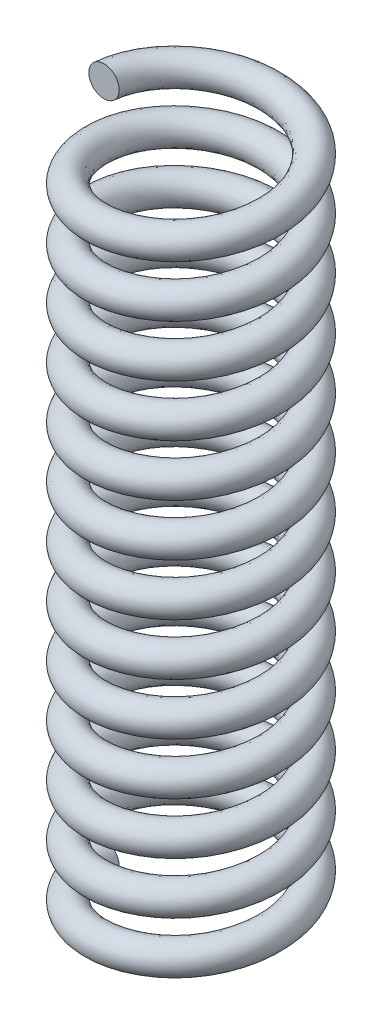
ISO-10303-21;
HEADER;
FILE_DESCRIPTION(('STEP AP214'),'2;1');
FILE_NAME('part.step','',(''),(''),'','','');
FILE_SCHEMA(('AUTOMOTIVE_DESIGN { 1 0 10303 214 1 1 1 1 }'));
ENDSEC;
DATA;
#1=APPLICATION_CONTEXT('core data for automotive mechanical design processes');
#2=APPLICATION_PROTOCOL_DEFINITION('international standard','automotive_design',2000,#1);
#3=PRODUCT_CONTEXT('',#1,'mechanical');
#4=PRODUCT('Part','Part','',(#3));
#5=PRODUCT_RELATED_PRODUCT_CATEGORY('part','',(#4));
#6=PRODUCT_DEFINITION_FORMATION('','',#4);
#7=PRODUCT_DEFINITION_CONTEXT('part definition',#1,'design');
#8=PRODUCT_DEFINITION('design','',#6,#7);
#9=PRODUCT_DEFINITION_SHAPE('','',#8);
#10=(LENGTH_UNIT() NAMED_UNIT(*) SI_UNIT(.MILLI.,.METRE.));
#11=(NAMED_UNIT(*) PLANE_ANGLE_UNIT() SI_UNIT($,.RADIAN.));
#12=(NAMED_UNIT(*) SI_UNIT($,.STERADIAN.) SOLID_ANGLE_UNIT());
#13=UNCERTAINTY_MEASURE_WITH_UNIT(LENGTH_MEASURE(1.E-05),#10,'distance_accuracy_value','');
#14=(GEOMETRIC_REPRESENTATION_CONTEXT(3) GLOBAL_UNCERTAINTY_ASSIGNED_CONTEXT((#13)) GLOBAL_UNIT_ASSIGNED_CONTEXT((#10,
#11,#12)) REPRESENTATION_CONTEXT('',''));
#15=CARTESIAN_POINT('',(0.,0.,0.));
#16=DIRECTION('',(0.,0.,1.));
#17=DIRECTION('',(1.,0.,0.));
#18=AXIS2_PLACEMENT_3D('',#15,#16,#17);
#19=CARTESIAN_POINT('',(-1.8923,12.5819825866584,0.));
#20=DIRECTION('',(0.,0.,1.));
#21=DIRECTION('',(1.,0.,0.));
#22=AXIS2_PLACEMENT_3D('',#19,#20,#21);
#23=PLANE('',#22);
#24=CARTESIAN_POINT('',(-1.8923,12.5819825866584,0.));
#25=DIRECTION('',(0.,0.,1.));
#26=DIRECTION('',(1.,0.,0.));
#27=AXIS2_PLACEMENT_3D('',#24,#25,#26);
#28=CIRCLE('',#27,0.330199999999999);
#29=CARTESIAN_POINT('',(-1.5621,12.5819825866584,0.));
#30=VERTEX_POINT('',#29);
#31=EDGE_CURVE('E40',#30,#30,#28,.T.);
#32=ORIENTED_EDGE('',*,*,#31,.T.);
#33=EDGE_LOOP('',(#32));
#34=FACE_BOUND('',#33,.T.);
#35=ADVANCED_FACE('F33',(#34),#23,.T.);
#36=CARTESIAN_POINT('',(-1.8923,-2.0284340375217,-3.3011476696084E-13));
#37=DIRECTION('',(-1.74451602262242E-13,0.,1.));
#38=DIRECTION('',(1.,0.,1.74451602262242E-13));
#39=AXIS2_PLACEMENT_3D('',#36,#37,#38);
#40=PLANE('',#39);
#41=CARTESIAN_POINT('',(-1.8923,-2.0284340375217,-3.3011476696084E-13));
#42=DIRECTION('',(-1.74451602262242E-13,0.,1.));
#43=DIRECTION('',(1.,0.,1.74451602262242E-13));
#44=AXIS2_PLACEMENT_3D('',#41,#42,#43);
#45=CIRCLE('',#44,0.330199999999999);
#46=CARTESIAN_POINT('',(-1.5621,-2.0284340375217,-2.72510847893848E-13));
#47=VERTEX_POINT('',#46);
#48=EDGE_CURVE('E11',#47,#47,#45,.T.);
#49=ORIENTED_EDGE('',*,*,#48,.F.);
#50=EDGE_LOOP('',(#49));
#51=FACE_BOUND('',#50,.T.);
#52=ADVANCED_FACE('F49',(#51),#40,.F.);
#53=CARTESIAN_POINT('',(-1.5621,12.5819825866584,0.));
#54=CARTESIAN_POINT('',(-1.5621,12.4883260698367,-0.901878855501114));
#55=CARTESIAN_POINT('',(-0.781050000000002,12.3946695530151,-1.35281828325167));
#56=CARTESIAN_POINT('',(0.,12.3010130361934,-1.80375771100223));
#57=CARTESIAN_POINT('',(0.781049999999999,12.2073565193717,-1.35281828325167));
#58=CARTESIAN_POINT('',(1.5621,12.1137000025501,-0.901878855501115));
#59=CARTESIAN_POINT('',(1.5621,12.0200434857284,0.));
#60=CARTESIAN_POINT('',(1.5621,11.9263869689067,0.901878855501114));
#61=CARTESIAN_POINT('',(0.78105,11.8327304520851,1.35281828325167));
#62=CARTESIAN_POINT('',(0.,11.7390739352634,1.80375771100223));
#63=CARTESIAN_POINT('',(-0.78105,11.6454174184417,1.35281828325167));
#64=CARTESIAN_POINT('',(-1.5621,11.5517609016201,0.901878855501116));
#65=CARTESIAN_POINT('',(-1.5621,11.4581043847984,0.));
#66=CARTESIAN_POINT('',(-1.5621,11.3644478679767,-0.901878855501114));
#67=CARTESIAN_POINT('',(-0.781050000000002,11.2707913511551,-1.35281828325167));
#68=CARTESIAN_POINT('',(0.,11.1771348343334,-1.80375771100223));
#69=CARTESIAN_POINT('',(0.781049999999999,11.0834783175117,-1.35281828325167));
#70=CARTESIAN_POINT('',(1.5621,10.9898218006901,-0.901878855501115));
#71=CARTESIAN_POINT('',(1.5621,10.8961652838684,0.));
#72=CARTESIAN_POINT('',(1.5621,10.8025087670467,0.901878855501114));
#73=CARTESIAN_POINT('',(0.78105,10.7088522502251,1.35281828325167));
#74=CARTESIAN_POINT('',(0.,10.6151957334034,1.80375771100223));
#75=CARTESIAN_POINT('',(-0.78105,10.5215392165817,1.35281828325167));
#76=CARTESIAN_POINT('',(-1.5621,10.4278826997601,0.901878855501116));
#77=CARTESIAN_POINT('',(-1.5621,10.3342261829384,0.));
#78=CARTESIAN_POINT('',(-1.5621,10.2405696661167,-0.901878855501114));
#79=CARTESIAN_POINT('',(-0.781050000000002,10.1469131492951,-1.35281828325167));
#80=CARTESIAN_POINT('',(0.,10.0532566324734,-1.80375771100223));
#81=CARTESIAN_POINT('',(0.781049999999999,9.95960011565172,-1.35281828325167));
#82=CARTESIAN_POINT('',(1.5621,9.86594359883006,-0.901878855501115));
#83=CARTESIAN_POINT('',(1.5621,9.77228708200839,0.));
#84=CARTESIAN_POINT('',(1.5621,9.67863056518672,0.901878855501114));
#85=CARTESIAN_POINT('',(0.78105,9.58497404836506,1.35281828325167));
#86=CARTESIAN_POINT('',(0.,9.49131753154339,1.80375771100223));
#87=CARTESIAN_POINT('',(-0.78105,9.39766101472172,1.35281828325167));
#88=CARTESIAN_POINT('',(-1.5621,9.30400449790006,0.901878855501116));
#89=CARTESIAN_POINT('',(-1.5621,9.21034798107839,0.));
#90=CARTESIAN_POINT('',(-1.5621,9.11669146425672,-0.901878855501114));
#91=CARTESIAN_POINT('',(-0.781050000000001,9.02303494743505,-1.35281828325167));
#92=CARTESIAN_POINT('',(0.,8.92937843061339,-1.80375771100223));
#93=CARTESIAN_POINT('',(0.781049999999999,8.83572191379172,-1.35281828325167));
#94=CARTESIAN_POINT('',(1.5621,8.74206539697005,-0.901878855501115));
#95=CARTESIAN_POINT('',(1.5621,8.64840888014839,0.));
#96=CARTESIAN_POINT('',(1.5621,8.55475236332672,0.901878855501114));
#97=CARTESIAN_POINT('',(0.78105,8.46109584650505,1.35281828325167));
#98=CARTESIAN_POINT('',(0.,8.36743932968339,1.80375771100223));
#99=CARTESIAN_POINT('',(-0.78105,8.27378281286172,1.35281828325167));
#100=CARTESIAN_POINT('',(-1.5621,8.18012629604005,0.901878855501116));
#101=CARTESIAN_POINT('',(-1.5621,8.08646977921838,0.));
#102=CARTESIAN_POINT('',(-1.5621,7.99281326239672,-0.901878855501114));
#103=CARTESIAN_POINT('',(-0.781050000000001,7.89915674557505,-1.35281828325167));
#104=CARTESIAN_POINT('',(0.,7.80550022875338,-1.80375771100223));
#105=CARTESIAN_POINT('',(0.781049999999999,7.71184371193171,-1.35281828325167));
#106=CARTESIAN_POINT('',(1.5621,7.61818719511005,-0.901878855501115));
#107=CARTESIAN_POINT('',(1.5621,7.52453067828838,0.));
#108=CARTESIAN_POINT('',(1.5621,7.43087416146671,0.901878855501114));
#109=CARTESIAN_POINT('',(0.78105,7.33721764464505,1.35281828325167));
#110=CARTESIAN_POINT('',(0.,7.24356112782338,1.80375771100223));
#111=CARTESIAN_POINT('',(-0.78105,7.14990461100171,1.35281828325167));
#112=CARTESIAN_POINT('',(-1.5621,7.05624809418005,0.901878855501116));
#113=CARTESIAN_POINT('',(-1.5621,6.96259157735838,0.));
#114=CARTESIAN_POINT('',(-1.5621,6.86893506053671,-0.901878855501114));
#115=CARTESIAN_POINT('',(-0.781050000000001,6.77527854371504,-1.35281828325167));
#116=CARTESIAN_POINT('',(0.,6.68162202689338,-1.80375771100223));
#117=CARTESIAN_POINT('',(0.781049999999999,6.58796551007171,-1.35281828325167));
#118=CARTESIAN_POINT('',(1.5621,6.49430899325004,-0.901878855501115));
#119=CARTESIAN_POINT('',(1.5621,6.40065247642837,0.));
#120=CARTESIAN_POINT('',(1.5621,6.30699595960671,0.901878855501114));
#121=CARTESIAN_POINT('',(0.78105,6.21333944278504,1.35281828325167));
#122=CARTESIAN_POINT('',(0.,6.11968292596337,1.80375771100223));
#123=CARTESIAN_POINT('',(-0.78105,6.02602640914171,1.35281828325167));
#124=CARTESIAN_POINT('',(-1.5621,5.93236989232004,0.901878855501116));
#125=CARTESIAN_POINT('',(-1.5621,5.83871337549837,0.));
#126=CARTESIAN_POINT('',(-1.5621,5.74505685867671,-0.901878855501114));
#127=CARTESIAN_POINT('',(-0.781050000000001,5.65140034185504,-1.35281828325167));
#128=CARTESIAN_POINT('',(0.,5.55774382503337,-1.80375771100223));
#129=CARTESIAN_POINT('',(0.78105,5.4640873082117,-1.35281828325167));
#130=CARTESIAN_POINT('',(1.5621,5.37043079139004,-0.901878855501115));
#131=CARTESIAN_POINT('',(1.5621,5.27677427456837,0.));
#132=CARTESIAN_POINT('',(1.5621,5.1831177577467,0.901878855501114));
#133=CARTESIAN_POINT('',(0.781050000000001,5.08946124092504,1.35281828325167));
#134=CARTESIAN_POINT('',(0.,4.99580472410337,1.80375771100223));
#135=CARTESIAN_POINT('',(-0.78105,4.9021482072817,1.35281828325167));
#136=CARTESIAN_POINT('',(-1.5621,4.80849169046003,0.901878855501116));
#137=CARTESIAN_POINT('',(-1.5621,4.71483517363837,0.));
#138=CARTESIAN_POINT('',(-1.5621,4.6211786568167,-0.901878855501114));
#139=CARTESIAN_POINT('',(-0.781050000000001,4.52752213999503,-1.35281828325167));
#140=CARTESIAN_POINT('',(0.,4.43386562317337,-1.80375771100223));
#141=CARTESIAN_POINT('',(0.78105,4.3402091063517,-1.35281828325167));
#142=CARTESIAN_POINT('',(1.5621,4.24655258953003,-0.901878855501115));
#143=CARTESIAN_POINT('',(1.5621,4.15289607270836,0.));
#144=CARTESIAN_POINT('',(1.5621,4.0592395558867,0.901878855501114));
#145=CARTESIAN_POINT('',(0.781050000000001,3.96558303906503,1.35281828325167));
#146=CARTESIAN_POINT('',(0.,3.87192652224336,1.80375771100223));
#147=CARTESIAN_POINT('',(-0.781049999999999,3.7782700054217,1.35281828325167));
#148=CARTESIAN_POINT('',(-1.5621,3.68461348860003,0.901878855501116));
#149=CARTESIAN_POINT('',(-1.5621,3.59095697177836,0.));
#150=CARTESIAN_POINT('',(-1.5621,3.4973004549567,-0.901878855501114));
#151=CARTESIAN_POINT('',(-0.781050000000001,3.40364393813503,-1.35281828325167));
#152=CARTESIAN_POINT('',(0.,3.30998742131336,-1.80375771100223));
#153=CARTESIAN_POINT('',(0.78105,3.21633090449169,-1.35281828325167));
#154=CARTESIAN_POINT('',(1.5621,3.12267438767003,-0.901878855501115));
#155=CARTESIAN_POINT('',(1.5621,3.02901787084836,0.));
#156=CARTESIAN_POINT('',(1.5621,2.93536135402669,0.901878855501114));
#157=CARTESIAN_POINT('',(0.781050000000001,2.84170483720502,1.35281828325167));
#158=CARTESIAN_POINT('',(0.,2.74804832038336,1.80375771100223));
#159=CARTESIAN_POINT('',(-0.781049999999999,2.65439180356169,1.35281828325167));
#160=CARTESIAN_POINT('',(-1.5621,2.56073528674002,0.901878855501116));
#161=CARTESIAN_POINT('',(-1.5621,2.46707876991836,0.));
#162=CARTESIAN_POINT('',(-1.5621,2.37342225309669,-0.901878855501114));
#163=CARTESIAN_POINT('',(-0.781050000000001,2.27976573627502,-1.35281828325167));
#164=CARTESIAN_POINT('',(0.,2.18610921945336,-1.80375771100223));
#165=CARTESIAN_POINT('',(0.78105,2.09245270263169,-1.35281828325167));
#166=CARTESIAN_POINT('',(1.5621,1.99879618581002,-0.901878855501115));
#167=CARTESIAN_POINT('',(1.5621,1.90513966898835,0.));
#168=CARTESIAN_POINT('',(1.5621,1.81148315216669,0.901878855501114));
#169=CARTESIAN_POINT('',(0.781050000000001,1.71782663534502,1.35281828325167));
#170=CARTESIAN_POINT('',(0.,1.62417011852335,1.80375771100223));
#171=CARTESIAN_POINT('',(-0.781049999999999,1.53051360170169,1.35281828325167));
#172=CARTESIAN_POINT('',(-1.5621,1.43685708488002,0.901878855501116));
#173=CARTESIAN_POINT('',(-1.5621,1.34320056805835,0.));
#174=CARTESIAN_POINT('',(-1.5621,1.24954405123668,-0.901878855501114));
#175=CARTESIAN_POINT('',(-0.78105,1.15588753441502,-1.35281828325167));
#176=CARTESIAN_POINT('',(0.,1.06223101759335,-1.80375771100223));
#177=CARTESIAN_POINT('',(0.78105,0.968574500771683,-1.35281828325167));
#178=CARTESIAN_POINT('',(1.5621,0.874917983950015,-0.901878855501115));
#179=CARTESIAN_POINT('',(1.5621,0.781261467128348,0.));
#180=CARTESIAN_POINT('',(1.5621,0.68760495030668,0.901878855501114));
#181=CARTESIAN_POINT('',(0.781050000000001,0.593948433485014,1.35281828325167));
#182=CARTESIAN_POINT('',(0.,0.500291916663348,1.80375771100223));
#183=CARTESIAN_POINT('',(-0.781049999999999,0.40663539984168,1.35281828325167));
#184=CARTESIAN_POINT('',(-1.5621,0.312978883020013,0.901878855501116));
#185=CARTESIAN_POINT('',(-1.5621,0.219322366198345,0.));
#186=CARTESIAN_POINT('',(-1.5621,0.125665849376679,-0.901878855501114));
#187=CARTESIAN_POINT('',(-0.78105,0.0320093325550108,-1.35281828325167));
#188=CARTESIAN_POINT('',(0.,-0.0616471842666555,-1.80375771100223));
#189=CARTESIAN_POINT('',(0.78105,-0.155303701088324,-1.35281828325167));
#190=CARTESIAN_POINT('',(1.5621,-0.24896021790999,-0.901878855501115));
#191=CARTESIAN_POINT('',(1.5621,-0.342616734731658,0.));
#192=CARTESIAN_POINT('',(1.5621,-0.436273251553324,0.901878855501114));
#193=CARTESIAN_POINT('',(0.781050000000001,-0.529929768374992,1.35281828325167));
#194=CARTESIAN_POINT('',(0.,-0.623586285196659,1.80375771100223));
#195=CARTESIAN_POINT('',(-0.781049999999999,-0.717242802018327,1.35281828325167));
#196=CARTESIAN_POINT('',(-1.5621,-0.810899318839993,0.901878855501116));
#197=CARTESIAN_POINT('',(-1.5621,-0.904555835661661,0.));
#198=CARTESIAN_POINT('',(-1.5621,-0.998212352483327,-0.901878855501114));
#199=CARTESIAN_POINT('',(-0.78105,-1.09186886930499,-1.35281828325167));
#200=CARTESIAN_POINT('',(0.,-1.18552538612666,-1.80375771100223));
#201=CARTESIAN_POINT('',(0.78105,-1.27918190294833,-1.35281828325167));
#202=CARTESIAN_POINT('',(1.5621,-1.37283841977,-0.901878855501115));
#203=CARTESIAN_POINT('',(1.5621,-1.46649493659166,0.));
#204=CARTESIAN_POINT('',(1.5621,-1.56015145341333,0.901878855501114));
#205=CARTESIAN_POINT('',(0.781050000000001,-1.653807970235,1.35281828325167));
#206=CARTESIAN_POINT('',(0.,-1.74746448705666,1.80375771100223));
#207=CARTESIAN_POINT('',(-0.781049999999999,-1.84112100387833,1.35281828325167));
#208=CARTESIAN_POINT('',(-1.5621,-1.9347775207,0.901878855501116));
#209=CARTESIAN_POINT('',(-1.5621,-2.02843403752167,0.));
#210=CARTESIAN_POINT('',(-1.5621,-2.12209055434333,-0.901878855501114));
#211=CARTESIAN_POINT('',(-0.78105,-2.215747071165,-1.35281828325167));
#212=CARTESIAN_POINT('',(0.,-2.30940358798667,-1.80375771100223));
#213=CARTESIAN_POINT('',(0.78105,-2.40306010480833,-1.35281828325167));
#214=CARTESIAN_POINT('',(1.5621,-2.49671662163,-0.901878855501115));
#215=CARTESIAN_POINT('',(1.5621,-2.59037313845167,0.));
#216=CARTESIAN_POINT('',(1.5621,-2.68402965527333,0.901878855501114));
#217=CARTESIAN_POINT('',(0.781050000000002,-2.777686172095,1.35281828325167));
#218=CARTESIAN_POINT('',(0.,-2.87134268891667,1.80375771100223));
#219=CARTESIAN_POINT('',(-0.781049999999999,-2.96499920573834,1.35281828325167));
#220=CARTESIAN_POINT('',(-1.5621,-3.05865572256,0.901878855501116));
#221=CARTESIAN_POINT('',(-1.5621,-3.15231223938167,0.));
#222=CARTESIAN_POINT('',(-1.5621,13.2423825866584,0.));
#223=CARTESIAN_POINT('',(-1.5621,13.1487260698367,-0.901878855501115));
#224=CARTESIAN_POINT('',(-0.781050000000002,13.0550695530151,-1.35281828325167));
#225=CARTESIAN_POINT('',(0.,12.9614130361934,-1.80375771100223));
#226=CARTESIAN_POINT('',(0.781049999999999,12.8677565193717,-1.35281828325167));
#227=CARTESIAN_POINT('',(1.5621,12.7741000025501,-0.901878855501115));
#228=CARTESIAN_POINT('',(1.5621,12.6804434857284,0.));
#229=CARTESIAN_POINT('',(1.5621,12.5867869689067,0.901878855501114));
#230=CARTESIAN_POINT('',(0.78105,12.4931304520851,1.35281828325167));
#231=CARTESIAN_POINT('',(0.,12.3994739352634,1.80375771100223));
#232=CARTESIAN_POINT('',(-0.781050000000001,12.3058174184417,1.35281828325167));
#233=CARTESIAN_POINT('',(-1.5621,12.2121609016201,0.901878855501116));
#234=CARTESIAN_POINT('',(-1.5621,12.1185043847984,0.));
#235=CARTESIAN_POINT('',(-1.5621,12.0248478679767,-0.901878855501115));
#236=CARTESIAN_POINT('',(-0.781050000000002,11.9311913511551,-1.35281828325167));
#237=CARTESIAN_POINT('',(0.,11.8375348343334,-1.80375771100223));
#238=CARTESIAN_POINT('',(0.781049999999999,11.7438783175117,-1.35281828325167));
#239=CARTESIAN_POINT('',(1.5621,11.6502218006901,-0.901878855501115));
#240=CARTESIAN_POINT('',(1.5621,11.5565652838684,0.));
#241=CARTESIAN_POINT('',(1.5621,11.4629087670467,0.901878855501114));
#242=CARTESIAN_POINT('',(0.78105,11.3692522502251,1.35281828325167));
#243=CARTESIAN_POINT('',(0.,11.2755957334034,1.80375771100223));
#244=CARTESIAN_POINT('',(-0.781050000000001,11.1819392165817,1.35281828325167));
#245=CARTESIAN_POINT('',(-1.5621,11.0882826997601,0.901878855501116));
#246=CARTESIAN_POINT('',(-1.5621,10.9946261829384,0.));
#247=CARTESIAN_POINT('',(-1.5621,10.9009696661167,-0.901878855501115));
#248=CARTESIAN_POINT('',(-0.781050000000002,10.8073131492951,-1.35281828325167));
#249=CARTESIAN_POINT('',(0.,10.7136566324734,-1.80375771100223));
#250=CARTESIAN_POINT('',(0.781049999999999,10.6200001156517,-1.35281828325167));
#251=CARTESIAN_POINT('',(1.5621,10.5263435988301,-0.901878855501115));
#252=CARTESIAN_POINT('',(1.5621,10.4326870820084,0.));
#253=CARTESIAN_POINT('',(1.5621,10.3390305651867,0.901878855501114));
#254=CARTESIAN_POINT('',(0.78105,10.2453740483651,1.35281828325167));
#255=CARTESIAN_POINT('',(0.,10.1517175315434,1.80375771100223));
#256=CARTESIAN_POINT('',(-0.78105,10.0580610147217,1.35281828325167));
#257=CARTESIAN_POINT('',(-1.5621,9.96440449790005,0.901878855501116));
#258=CARTESIAN_POINT('',(-1.5621,9.87074798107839,0.));
#259=CARTESIAN_POINT('',(-1.5621,9.77709146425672,-0.901878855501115));
#260=CARTESIAN_POINT('',(-0.781050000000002,9.68343494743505,-1.35281828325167));
#261=CARTESIAN_POINT('',(0.,9.58977843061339,-1.80375771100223));
#262=CARTESIAN_POINT('',(0.781049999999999,9.49612191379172,-1.35281828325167));
#263=CARTESIAN_POINT('',(1.5621,9.40246539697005,-0.901878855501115));
#264=CARTESIAN_POINT('',(1.5621,9.30880888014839,0.));
#265=CARTESIAN_POINT('',(1.5621,9.21515236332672,0.901878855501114));
#266=CARTESIAN_POINT('',(0.78105,9.12149584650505,1.35281828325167));
#267=CARTESIAN_POINT('',(0.,9.02783932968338,1.80375771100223));
#268=CARTESIAN_POINT('',(-0.78105,8.93418281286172,1.35281828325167));
#269=CARTESIAN_POINT('',(-1.5621,8.84052629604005,0.901878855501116));
#270=CARTESIAN_POINT('',(-1.5621,8.74686977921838,0.));
#271=CARTESIAN_POINT('',(-1.5621,8.65321326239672,-0.901878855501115));
#272=CARTESIAN_POINT('',(-0.781050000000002,8.55955674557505,-1.35281828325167));
#273=CARTESIAN_POINT('',(0.,8.46590022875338,-1.80375771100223));
#274=CARTESIAN_POINT('',(0.781049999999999,8.37224371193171,-1.35281828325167));
#275=CARTESIAN_POINT('',(1.5621,8.27858719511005,-0.901878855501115));
#276=CARTESIAN_POINT('',(1.5621,8.18493067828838,0.));
#277=CARTESIAN_POINT('',(1.5621,8.09127416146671,0.901878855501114));
#278=CARTESIAN_POINT('',(0.78105,7.99761764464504,1.35281828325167));
#279=CARTESIAN_POINT('',(0.,7.90396112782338,1.80375771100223));
#280=CARTESIAN_POINT('',(-0.78105,7.81030461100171,1.35281828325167));
#281=CARTESIAN_POINT('',(-1.5621,7.71664809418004,0.901878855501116));
#282=CARTESIAN_POINT('',(-1.5621,7.62299157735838,0.));
#283=CARTESIAN_POINT('',(-1.5621,7.52933506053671,-0.901878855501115));
#284=CARTESIAN_POINT('',(-0.781050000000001,7.43567854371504,-1.35281828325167));
#285=CARTESIAN_POINT('',(0.,7.34202202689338,-1.80375771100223));
#286=CARTESIAN_POINT('',(0.781049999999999,7.24836551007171,-1.35281828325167));
#287=CARTESIAN_POINT('',(1.5621,7.15470899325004,-0.901878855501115));
#288=CARTESIAN_POINT('',(1.5621,7.06105247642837,0.));
#289=CARTESIAN_POINT('',(1.5621,6.96739595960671,0.901878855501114));
#290=CARTESIAN_POINT('',(0.78105,6.87373944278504,1.35281828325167));
#291=CARTESIAN_POINT('',(0.,6.78008292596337,1.80375771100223));
#292=CARTESIAN_POINT('',(-0.78105,6.6864264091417,1.35281828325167));
#293=CARTESIAN_POINT('',(-1.5621,6.59276989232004,0.901878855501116));
#294=CARTESIAN_POINT('',(-1.5621,6.49911337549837,0.));
#295=CARTESIAN_POINT('',(-1.5621,6.4054568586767,-0.901878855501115));
#296=CARTESIAN_POINT('',(-0.781050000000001,6.31180034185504,-1.35281828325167));
#297=CARTESIAN_POINT('',(0.,6.21814382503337,-1.80375771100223));
#298=CARTESIAN_POINT('',(0.78105,6.1244873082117,-1.35281828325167));
#299=CARTESIAN_POINT('',(1.5621,6.03083079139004,-0.901878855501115));
#300=CARTESIAN_POINT('',(1.5621,5.93717427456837,0.));
#301=CARTESIAN_POINT('',(1.5621,5.8435177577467,0.901878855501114));
#302=CARTESIAN_POINT('',(0.781050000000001,5.74986124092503,1.35281828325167));
#303=CARTESIAN_POINT('',(0.,5.65620472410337,1.80375771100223));
#304=CARTESIAN_POINT('',(-0.78105,5.5625482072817,1.35281828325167));
#305=CARTESIAN_POINT('',(-1.5621,5.46889169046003,0.901878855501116));
#306=CARTESIAN_POINT('',(-1.5621,5.37523517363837,0.));
#307=CARTESIAN_POINT('',(-1.5621,5.2815786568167,-0.901878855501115));
#308=CARTESIAN_POINT('',(-0.781050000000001,5.18792213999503,-1.35281828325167));
#309=CARTESIAN_POINT('',(0.,5.09426562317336,-1.80375771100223));
#310=CARTESIAN_POINT('',(0.78105,5.0006091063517,-1.35281828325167));
#311=CARTESIAN_POINT('',(1.5621,4.90695258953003,-0.901878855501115));
#312=CARTESIAN_POINT('',(1.5621,4.81329607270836,0.));
#313=CARTESIAN_POINT('',(1.5621,4.7196395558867,0.901878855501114));
#314=CARTESIAN_POINT('',(0.781050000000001,4.62598303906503,1.35281828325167));
#315=CARTESIAN_POINT('',(0.,4.53232652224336,1.80375771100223));
#316=CARTESIAN_POINT('',(-0.78105,4.4386700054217,1.35281828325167));
#317=CARTESIAN_POINT('',(-1.5621,4.34501348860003,0.901878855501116));
#318=CARTESIAN_POINT('',(-1.5621,4.25135697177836,0.));
#319=CARTESIAN_POINT('',(-1.5621,4.15770045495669,-0.901878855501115));
#320=CARTESIAN_POINT('',(-0.781050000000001,4.06404393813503,-1.35281828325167));
#321=CARTESIAN_POINT('',(0.,3.97038742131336,-1.80375771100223));
#322=CARTESIAN_POINT('',(0.78105,3.87673090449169,-1.35281828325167));
#323=CARTESIAN_POINT('',(1.5621,3.78307438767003,-0.901878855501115));
#324=CARTESIAN_POINT('',(1.5621,3.68941787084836,0.));
#325=CARTESIAN_POINT('',(1.5621,3.59576135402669,0.901878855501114));
#326=CARTESIAN_POINT('',(0.781050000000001,3.50210483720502,1.35281828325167));
#327=CARTESIAN_POINT('',(0.,3.40844832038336,1.80375771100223));
#328=CARTESIAN_POINT('',(-0.78105,3.31479180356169,1.35281828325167));
#329=CARTESIAN_POINT('',(-1.5621,3.22113528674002,0.901878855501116));
#330=CARTESIAN_POINT('',(-1.5621,3.12747876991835,0.));
#331=CARTESIAN_POINT('',(-1.5621,3.03382225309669,-0.901878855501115));
#332=CARTESIAN_POINT('',(-0.781050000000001,2.94016573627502,-1.35281828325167));
#333=CARTESIAN_POINT('',(0.,2.84650921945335,-1.80375771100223));
#334=CARTESIAN_POINT('',(0.78105,2.75285270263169,-1.35281828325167));
#335=CARTESIAN_POINT('',(1.5621,2.65919618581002,-0.901878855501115));
#336=CARTESIAN_POINT('',(1.5621,2.56553966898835,0.));
#337=CARTESIAN_POINT('',(1.5621,2.47188315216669,0.901878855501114));
#338=CARTESIAN_POINT('',(0.781050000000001,2.37822663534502,1.35281828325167));
#339=CARTESIAN_POINT('',(0.,2.28457011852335,1.80375771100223));
#340=CARTESIAN_POINT('',(-0.781049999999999,2.19091360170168,1.35281828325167));
#341=CARTESIAN_POINT('',(-1.5621,2.09725708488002,0.901878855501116));
#342=CARTESIAN_POINT('',(-1.5621,2.00360056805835,0.));
#343=CARTESIAN_POINT('',(-1.5621,1.90994405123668,-0.901878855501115));
#344=CARTESIAN_POINT('',(-0.781050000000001,1.81628753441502,-1.35281828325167));
#345=CARTESIAN_POINT('',(0.,1.72263101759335,-1.80375771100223));
#346=CARTESIAN_POINT('',(0.78105,1.62897450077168,-1.35281828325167));
#347=CARTESIAN_POINT('',(1.5621,1.53531798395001,-0.901878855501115));
#348=CARTESIAN_POINT('',(1.5621,1.44166146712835,0.));
#349=CARTESIAN_POINT('',(1.5621,1.34800495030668,0.901878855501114));
#350=CARTESIAN_POINT('',(0.781050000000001,1.25434843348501,1.35281828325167));
#351=CARTESIAN_POINT('',(0.,1.16069191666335,1.80375771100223));
#352=CARTESIAN_POINT('',(-0.781049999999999,1.06703539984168,1.35281828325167));
#353=CARTESIAN_POINT('',(-1.5621,0.973378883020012,0.901878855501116));
#354=CARTESIAN_POINT('',(-1.5621,0.879722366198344,0.));
#355=CARTESIAN_POINT('',(-1.5621,0.786065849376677,-0.901878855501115));
#356=CARTESIAN_POINT('',(-0.781050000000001,0.692409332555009,-1.35281828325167));
#357=CARTESIAN_POINT('',(0.,0.598752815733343,-1.80375771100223));
#358=CARTESIAN_POINT('',(0.78105,0.505096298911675,-1.35281828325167));
#359=CARTESIAN_POINT('',(1.5621,0.411439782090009,-0.901878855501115));
#360=CARTESIAN_POINT('',(1.5621,0.317783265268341,0.));
#361=CARTESIAN_POINT('',(1.5621,0.224126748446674,0.901878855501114));
#362=CARTESIAN_POINT('',(0.781050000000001,0.130470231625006,1.35281828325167));
#363=CARTESIAN_POINT('',(0.,0.0368137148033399,1.80375771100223));
#364=CARTESIAN_POINT('',(-0.781049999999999,-0.0568428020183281,1.35281828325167));
#365=CARTESIAN_POINT('',(-1.5621,-0.150499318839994,0.901878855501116));
#366=CARTESIAN_POINT('',(-1.5621,-0.244155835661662,0.));
#367=CARTESIAN_POINT('',(-1.5621,-0.337812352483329,-0.901878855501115));
#368=CARTESIAN_POINT('',(-0.78105,-0.431468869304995,-1.35281828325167));
#369=CARTESIAN_POINT('',(0.,-0.525125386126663,-1.80375771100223));
#370=CARTESIAN_POINT('',(0.78105,-0.618781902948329,-1.35281828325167));
#371=CARTESIAN_POINT('',(1.5621,-0.712438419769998,-0.901878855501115));
#372=CARTESIAN_POINT('',(1.5621,-0.806094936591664,0.));
#373=CARTESIAN_POINT('',(1.5621,-0.899751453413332,0.901878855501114));
#374=CARTESIAN_POINT('',(0.781050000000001,-0.993407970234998,1.35281828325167));
#375=CARTESIAN_POINT('',(0.,-1.08706448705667,1.80375771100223));
#376=CARTESIAN_POINT('',(-0.781049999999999,-1.18072100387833,1.35281828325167));
#377=CARTESIAN_POINT('',(-1.5621,-1.2743775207,0.901878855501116));
#378=CARTESIAN_POINT('',(-1.5621,-1.36803403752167,0.));
#379=CARTESIAN_POINT('',(-1.5621,-1.46169055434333,-0.901878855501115));
#380=CARTESIAN_POINT('',(-0.78105,-1.555347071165,-1.35281828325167));
#381=CARTESIAN_POINT('',(0.,-1.64900358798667,-1.80375771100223));
#382=CARTESIAN_POINT('',(0.78105,-1.74266010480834,-1.35281828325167));
#383=CARTESIAN_POINT('',(1.5621,-1.83631662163,-0.901878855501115));
#384=CARTESIAN_POINT('',(1.5621,-1.92997313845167,0.));
#385=CARTESIAN_POINT('',(1.5621,-2.02362965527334,0.901878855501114));
#386=CARTESIAN_POINT('',(0.781050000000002,-2.117286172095,1.35281828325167));
#387=CARTESIAN_POINT('',(0.,-2.21094268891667,1.80375771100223));
#388=CARTESIAN_POINT('',(-0.781049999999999,-2.30459920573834,1.35281828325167));
#389=CARTESIAN_POINT('',(-1.5621,-2.39825572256,0.901878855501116));
#390=CARTESIAN_POINT('',(-1.5621,-2.49191223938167,0.));
#391=CARTESIAN_POINT('',(-2.2225,13.2423825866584,0.));
#392=CARTESIAN_POINT('',(-2.2225,13.1487260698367,-1.28316097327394));
#393=CARTESIAN_POINT('',(-1.11125,13.0550695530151,-1.92474145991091));
#394=CARTESIAN_POINT('',(0.,12.9614130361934,-2.56632194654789));
#395=CARTESIAN_POINT('',(1.11125,12.8677565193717,-1.92474145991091));
#396=CARTESIAN_POINT('',(2.2225,12.7741000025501,-1.28316097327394));
#397=CARTESIAN_POINT('',(2.2225,12.6804434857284,0.));
#398=CARTESIAN_POINT('',(2.2225,12.5867869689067,1.28316097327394));
#399=CARTESIAN_POINT('',(1.11125,12.4931304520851,1.92474145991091));
#400=CARTESIAN_POINT('',(0.,12.3994739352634,2.56632194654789));
#401=CARTESIAN_POINT('',(-1.11125,12.3058174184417,1.92474145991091));
#402=CARTESIAN_POINT('',(-2.2225,12.2121609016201,1.28316097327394));
#403=CARTESIAN_POINT('',(-2.2225,12.1185043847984,0.));
#404=CARTESIAN_POINT('',(-2.2225,12.0248478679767,-1.28316097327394));
#405=CARTESIAN_POINT('',(-1.11125,11.9311913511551,-1.92474145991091));
#406=CARTESIAN_POINT('',(0.,11.8375348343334,-2.56632194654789));
#407=CARTESIAN_POINT('',(1.11125,11.7438783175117,-1.92474145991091));
#408=CARTESIAN_POINT('',(2.2225,11.6502218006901,-1.28316097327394));
#409=CARTESIAN_POINT('',(2.2225,11.5565652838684,0.));
#410=CARTESIAN_POINT('',(2.2225,11.4629087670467,1.28316097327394));
#411=CARTESIAN_POINT('',(1.11125,11.3692522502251,1.92474145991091));
#412=CARTESIAN_POINT('',(0.,11.2755957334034,2.56632194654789));
#413=CARTESIAN_POINT('',(-1.11125,11.1819392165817,1.92474145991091));
#414=CARTESIAN_POINT('',(-2.2225,11.0882826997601,1.28316097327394));
#415=CARTESIAN_POINT('',(-2.2225,10.9946261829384,0.));
#416=CARTESIAN_POINT('',(-2.2225,10.9009696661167,-1.28316097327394));
#417=CARTESIAN_POINT('',(-1.11125,10.8073131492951,-1.92474145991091));
#418=CARTESIAN_POINT('',(0.,10.7136566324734,-2.56632194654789));
#419=CARTESIAN_POINT('',(1.11125,10.6200001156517,-1.92474145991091));
#420=CARTESIAN_POINT('',(2.2225,10.5263435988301,-1.28316097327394));
#421=CARTESIAN_POINT('',(2.2225,10.4326870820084,0.));
#422=CARTESIAN_POINT('',(2.2225,10.3390305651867,1.28316097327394));
#423=CARTESIAN_POINT('',(1.11125,10.2453740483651,1.92474145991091));
#424=CARTESIAN_POINT('',(0.,10.1517175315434,2.56632194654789));
#425=CARTESIAN_POINT('',(-1.11125,10.0580610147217,1.92474145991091));
#426=CARTESIAN_POINT('',(-2.2225,9.96440449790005,1.28316097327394));
#427=CARTESIAN_POINT('',(-2.2225,9.87074798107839,0.));
#428=CARTESIAN_POINT('',(-2.2225,9.77709146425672,-1.28316097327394));
#429=CARTESIAN_POINT('',(-1.11125,9.68343494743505,-1.92474145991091));
#430=CARTESIAN_POINT('',(0.,9.58977843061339,-2.56632194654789));
#431=CARTESIAN_POINT('',(1.11125,9.49612191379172,-1.92474145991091));
#432=CARTESIAN_POINT('',(2.2225,9.40246539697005,-1.28316097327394));
#433=CARTESIAN_POINT('',(2.2225,9.30880888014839,0.));
#434=CARTESIAN_POINT('',(2.2225,9.21515236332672,1.28316097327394));
#435=CARTESIAN_POINT('',(1.11125,9.12149584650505,1.92474145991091));
#436=CARTESIAN_POINT('',(0.,9.02783932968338,2.56632194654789));
#437=CARTESIAN_POINT('',(-1.11125,8.93418281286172,1.92474145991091));
#438=CARTESIAN_POINT('',(-2.2225,8.84052629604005,1.28316097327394));
#439=CARTESIAN_POINT('',(-2.2225,8.74686977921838,0.));
#440=CARTESIAN_POINT('',(-2.2225,8.65321326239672,-1.28316097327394));
#441=CARTESIAN_POINT('',(-1.11125,8.55955674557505,-1.92474145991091));
#442=CARTESIAN_POINT('',(0.,8.46590022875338,-2.56632194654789));
#443=CARTESIAN_POINT('',(1.11125,8.37224371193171,-1.92474145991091));
#444=CARTESIAN_POINT('',(2.2225,8.27858719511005,-1.28316097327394));
#445=CARTESIAN_POINT('',(2.2225,8.18493067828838,0.));
#446=CARTESIAN_POINT('',(2.2225,8.09127416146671,1.28316097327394));
#447=CARTESIAN_POINT('',(1.11125,7.99761764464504,1.92474145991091));
#448=CARTESIAN_POINT('',(0.,7.90396112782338,2.56632194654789));
#449=CARTESIAN_POINT('',(-1.11125,7.81030461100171,1.92474145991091));
#450=CARTESIAN_POINT('',(-2.2225,7.71664809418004,1.28316097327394));
#451=CARTESIAN_POINT('',(-2.2225,7.62299157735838,0.));
#452=CARTESIAN_POINT('',(-2.2225,7.52933506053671,-1.28316097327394));
#453=CARTESIAN_POINT('',(-1.11125,7.43567854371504,-1.92474145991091));
#454=CARTESIAN_POINT('',(0.,7.34202202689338,-2.56632194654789));
#455=CARTESIAN_POINT('',(1.11125,7.24836551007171,-1.92474145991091));
#456=CARTESIAN_POINT('',(2.2225,7.15470899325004,-1.28316097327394));
#457=CARTESIAN_POINT('',(2.2225,7.06105247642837,0.));
#458=CARTESIAN_POINT('',(2.2225,6.96739595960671,1.28316097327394));
#459=CARTESIAN_POINT('',(1.11125,6.87373944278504,1.92474145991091));
#460=CARTESIAN_POINT('',(0.,6.78008292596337,2.56632194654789));
#461=CARTESIAN_POINT('',(-1.11125,6.6864264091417,1.92474145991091));
#462=CARTESIAN_POINT('',(-2.2225,6.59276989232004,1.28316097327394));
#463=CARTESIAN_POINT('',(-2.2225,6.49911337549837,0.));
#464=CARTESIAN_POINT('',(-2.2225,6.4054568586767,-1.28316097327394));
#465=CARTESIAN_POINT('',(-1.11125,6.31180034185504,-1.92474145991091));
#466=CARTESIAN_POINT('',(0.,6.21814382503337,-2.56632194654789));
#467=CARTESIAN_POINT('',(1.11125,6.1244873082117,-1.92474145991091));
#468=CARTESIAN_POINT('',(2.2225,6.03083079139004,-1.28316097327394));
#469=CARTESIAN_POINT('',(2.2225,5.93717427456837,0.));
#470=CARTESIAN_POINT('',(2.2225,5.8435177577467,1.28316097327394));
#471=CARTESIAN_POINT('',(1.11125,5.74986124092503,1.92474145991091));
#472=CARTESIAN_POINT('',(0.,5.65620472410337,2.56632194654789));
#473=CARTESIAN_POINT('',(-1.11125,5.5625482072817,1.92474145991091));
#474=CARTESIAN_POINT('',(-2.2225,5.46889169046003,1.28316097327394));
#475=CARTESIAN_POINT('',(-2.2225,5.37523517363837,0.));
#476=CARTESIAN_POINT('',(-2.2225,5.2815786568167,-1.28316097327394));
#477=CARTESIAN_POINT('',(-1.11125,5.18792213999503,-1.92474145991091));
#478=CARTESIAN_POINT('',(0.,5.09426562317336,-2.56632194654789));
#479=CARTESIAN_POINT('',(1.11125,5.0006091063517,-1.92474145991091));
#480=CARTESIAN_POINT('',(2.2225,4.90695258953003,-1.28316097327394));
#481=CARTESIAN_POINT('',(2.2225,4.81329607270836,0.));
#482=CARTESIAN_POINT('',(2.2225,4.7196395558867,1.28316097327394));
#483=CARTESIAN_POINT('',(1.11125,4.62598303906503,1.92474145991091));
#484=CARTESIAN_POINT('',(0.,4.53232652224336,2.56632194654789));
#485=CARTESIAN_POINT('',(-1.11125,4.4386700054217,1.92474145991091));
#486=CARTESIAN_POINT('',(-2.2225,4.34501348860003,1.28316097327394));
#487=CARTESIAN_POINT('',(-2.2225,4.25135697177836,0.));
#488=CARTESIAN_POINT('',(-2.2225,4.15770045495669,-1.28316097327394));
#489=CARTESIAN_POINT('',(-1.11125,4.06404393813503,-1.92474145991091));
#490=CARTESIAN_POINT('',(0.,3.97038742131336,-2.56632194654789));
#491=CARTESIAN_POINT('',(1.11125,3.87673090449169,-1.92474145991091));
#492=CARTESIAN_POINT('',(2.2225,3.78307438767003,-1.28316097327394));
#493=CARTESIAN_POINT('',(2.2225,3.68941787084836,0.));
#494=CARTESIAN_POINT('',(2.2225,3.59576135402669,1.28316097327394));
#495=CARTESIAN_POINT('',(1.11125,3.50210483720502,1.92474145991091));
#496=CARTESIAN_POINT('',(0.,3.40844832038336,2.56632194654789));
#497=CARTESIAN_POINT('',(-1.11125,3.31479180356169,1.92474145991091));
#498=CARTESIAN_POINT('',(-2.2225,3.22113528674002,1.28316097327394));
#499=CARTESIAN_POINT('',(-2.2225,3.12747876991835,0.));
#500=CARTESIAN_POINT('',(-2.2225,3.03382225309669,-1.28316097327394));
#501=CARTESIAN_POINT('',(-1.11125,2.94016573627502,-1.92474145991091));
#502=CARTESIAN_POINT('',(0.,2.84650921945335,-2.56632194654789));
#503=CARTESIAN_POINT('',(1.11125,2.75285270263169,-1.92474145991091));
#504=CARTESIAN_POINT('',(2.2225,2.65919618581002,-1.28316097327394));
#505=CARTESIAN_POINT('',(2.2225,2.56553966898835,0.));
#506=CARTESIAN_POINT('',(2.2225,2.47188315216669,1.28316097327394));
#507=CARTESIAN_POINT('',(1.11125,2.37822663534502,1.92474145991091));
#508=CARTESIAN_POINT('',(0.,2.28457011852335,2.56632194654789));
#509=CARTESIAN_POINT('',(-1.11125,2.19091360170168,1.92474145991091));
#510=CARTESIAN_POINT('',(-2.2225,2.09725708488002,1.28316097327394));
#511=CARTESIAN_POINT('',(-2.2225,2.00360056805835,0.));
#512=CARTESIAN_POINT('',(-2.2225,1.90994405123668,-1.28316097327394));
#513=CARTESIAN_POINT('',(-1.11125,1.81628753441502,-1.92474145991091));
#514=CARTESIAN_POINT('',(0.,1.72263101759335,-2.56632194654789));
#515=CARTESIAN_POINT('',(1.11125,1.62897450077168,-1.92474145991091));
#516=CARTESIAN_POINT('',(2.2225,1.53531798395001,-1.28316097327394));
#517=CARTESIAN_POINT('',(2.2225,1.44166146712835,0.));
#518=CARTESIAN_POINT('',(2.2225,1.34800495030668,1.28316097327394));
#519=CARTESIAN_POINT('',(1.11125,1.25434843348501,1.92474145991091));
#520=CARTESIAN_POINT('',(0.,1.16069191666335,2.56632194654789));
#521=CARTESIAN_POINT('',(-1.11125,1.06703539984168,1.92474145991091));
#522=CARTESIAN_POINT('',(-2.2225,0.973378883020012,1.28316097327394));
#523=CARTESIAN_POINT('',(-2.2225,0.879722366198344,0.));
#524=CARTESIAN_POINT('',(-2.2225,0.786065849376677,-1.28316097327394));
#525=CARTESIAN_POINT('',(-1.11125,0.692409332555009,-1.92474145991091));
#526=CARTESIAN_POINT('',(0.,0.598752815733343,-2.56632194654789));
#527=CARTESIAN_POINT('',(1.11125,0.505096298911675,-1.92474145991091));
#528=CARTESIAN_POINT('',(2.2225,0.411439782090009,-1.28316097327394));
#529=CARTESIAN_POINT('',(2.2225,0.317783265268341,0.));
#530=CARTESIAN_POINT('',(2.2225,0.224126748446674,1.28316097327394));
#531=CARTESIAN_POINT('',(1.11125,0.130470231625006,1.92474145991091));
#532=CARTESIAN_POINT('',(0.,0.0368137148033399,2.56632194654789));
#533=CARTESIAN_POINT('',(-1.11125,-0.0568428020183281,1.92474145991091));
#534=CARTESIAN_POINT('',(-2.2225,-0.150499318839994,1.28316097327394));
#535=CARTESIAN_POINT('',(-2.2225,-0.244155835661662,0.));
#536=CARTESIAN_POINT('',(-2.2225,-0.337812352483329,-1.28316097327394));
#537=CARTESIAN_POINT('',(-1.11125,-0.431468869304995,-1.92474145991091));
#538=CARTESIAN_POINT('',(0.,-0.525125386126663,-2.56632194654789));
#539=CARTESIAN_POINT('',(1.11125,-0.618781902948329,-1.92474145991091));
#540=CARTESIAN_POINT('',(2.2225,-0.712438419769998,-1.28316097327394));
#541=CARTESIAN_POINT('',(2.2225,-0.806094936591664,0.));
#542=CARTESIAN_POINT('',(2.2225,-0.899751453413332,1.28316097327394));
#543=CARTESIAN_POINT('',(1.11125,-0.993407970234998,1.92474145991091));
#544=CARTESIAN_POINT('',(0.,-1.08706448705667,2.56632194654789));
#545=CARTESIAN_POINT('',(-1.11125,-1.18072100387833,1.92474145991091));
#546=CARTESIAN_POINT('',(-2.2225,-1.2743775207,1.28316097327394));
#547=CARTESIAN_POINT('',(-2.2225,-1.36803403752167,0.));
#548=CARTESIAN_POINT('',(-2.2225,-1.46169055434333,-1.28316097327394));
#549=CARTESIAN_POINT('',(-1.11125,-1.555347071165,-1.92474145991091));
#550=CARTESIAN_POINT('',(0.,-1.64900358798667,-2.56632194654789));
#551=CARTESIAN_POINT('',(1.11125,-1.74266010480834,-1.92474145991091));
#552=CARTESIAN_POINT('',(2.2225,-1.83631662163,-1.28316097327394));
#553=CARTESIAN_POINT('',(2.2225,-1.92997313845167,0.));
#554=CARTESIAN_POINT('',(2.2225,-2.02362965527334,1.28316097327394));
#555=CARTESIAN_POINT('',(1.11125,-2.117286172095,1.92474145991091));
#556=CARTESIAN_POINT('',(0.,-2.21094268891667,2.56632194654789));
#557=CARTESIAN_POINT('',(-1.11125,-2.30459920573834,1.92474145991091));
#558=CARTESIAN_POINT('',(-2.2225,-2.39825572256,1.28316097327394));
#559=CARTESIAN_POINT('',(-2.2225,-2.49191223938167,0.));
#560=CARTESIAN_POINT('',(-2.2225,12.5819825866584,0.));
#561=CARTESIAN_POINT('',(-2.2225,12.4883260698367,-1.28316097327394));
#562=CARTESIAN_POINT('',(-1.11125,12.3946695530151,-1.92474145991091));
#563=CARTESIAN_POINT('',(0.,12.3010130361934,-2.56632194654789));
#564=CARTESIAN_POINT('',(1.11125,12.2073565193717,-1.92474145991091));
#565=CARTESIAN_POINT('',(2.2225,12.1137000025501,-1.28316097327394));
#566=CARTESIAN_POINT('',(2.2225,12.0200434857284,0.));
#567=CARTESIAN_POINT('',(2.2225,11.9263869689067,1.28316097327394));
#568=CARTESIAN_POINT('',(1.11125,11.8327304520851,1.92474145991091));
#569=CARTESIAN_POINT('',(0.,11.7390739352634,2.56632194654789));
#570=CARTESIAN_POINT('',(-1.11125,11.6454174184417,1.92474145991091));
#571=CARTESIAN_POINT('',(-2.2225,11.5517609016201,1.28316097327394));
#572=CARTESIAN_POINT('',(-2.2225,11.4581043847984,0.));
#573=CARTESIAN_POINT('',(-2.2225,11.3644478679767,-1.28316097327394));
#574=CARTESIAN_POINT('',(-1.11125,11.2707913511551,-1.92474145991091));
#575=CARTESIAN_POINT('',(0.,11.1771348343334,-2.56632194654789));
#576=CARTESIAN_POINT('',(1.11125,11.0834783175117,-1.92474145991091));
#577=CARTESIAN_POINT('',(2.2225,10.9898218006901,-1.28316097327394));
#578=CARTESIAN_POINT('',(2.2225,10.8961652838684,0.));
#579=CARTESIAN_POINT('',(2.2225,10.8025087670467,1.28316097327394));
#580=CARTESIAN_POINT('',(1.11125,10.7088522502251,1.92474145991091));
#581=CARTESIAN_POINT('',(0.,10.6151957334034,2.56632194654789));
#582=CARTESIAN_POINT('',(-1.11125,10.5215392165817,1.92474145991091));
#583=CARTESIAN_POINT('',(-2.2225,10.4278826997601,1.28316097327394));
#584=CARTESIAN_POINT('',(-2.2225,10.3342261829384,0.));
#585=CARTESIAN_POINT('',(-2.2225,10.2405696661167,-1.28316097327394));
#586=CARTESIAN_POINT('',(-1.11125,10.1469131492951,-1.92474145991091));
#587=CARTESIAN_POINT('',(0.,10.0532566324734,-2.56632194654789));
#588=CARTESIAN_POINT('',(1.11125,9.95960011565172,-1.92474145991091));
#589=CARTESIAN_POINT('',(2.2225,9.86594359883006,-1.28316097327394));
#590=CARTESIAN_POINT('',(2.2225,9.77228708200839,0.));
#591=CARTESIAN_POINT('',(2.2225,9.67863056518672,1.28316097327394));
#592=CARTESIAN_POINT('',(1.11125,9.58497404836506,1.92474145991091));
#593=CARTESIAN_POINT('',(0.,9.49131753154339,2.56632194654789));
#594=CARTESIAN_POINT('',(-1.11125,9.39766101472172,1.92474145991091));
#595=CARTESIAN_POINT('',(-2.2225,9.30400449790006,1.28316097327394));
#596=CARTESIAN_POINT('',(-2.2225,9.21034798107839,0.));
#597=CARTESIAN_POINT('',(-2.2225,9.11669146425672,-1.28316097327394));
#598=CARTESIAN_POINT('',(-1.11125,9.02303494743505,-1.92474145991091));
#599=CARTESIAN_POINT('',(0.,8.92937843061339,-2.56632194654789));
#600=CARTESIAN_POINT('',(1.11125,8.83572191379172,-1.92474145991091));
#601=CARTESIAN_POINT('',(2.2225,8.74206539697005,-1.28316097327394));
#602=CARTESIAN_POINT('',(2.2225,8.64840888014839,0.));
#603=CARTESIAN_POINT('',(2.2225,8.55475236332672,1.28316097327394));
#604=CARTESIAN_POINT('',(1.11125,8.46109584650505,1.92474145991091));
#605=CARTESIAN_POINT('',(0.,8.36743932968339,2.56632194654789));
#606=CARTESIAN_POINT('',(-1.11125,8.27378281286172,1.92474145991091));
#607=CARTESIAN_POINT('',(-2.2225,8.18012629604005,1.28316097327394));
#608=CARTESIAN_POINT('',(-2.2225,8.08646977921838,0.));
#609=CARTESIAN_POINT('',(-2.2225,7.99281326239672,-1.28316097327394));
#610=CARTESIAN_POINT('',(-1.11125,7.89915674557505,-1.92474145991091));
#611=CARTESIAN_POINT('',(0.,7.80550022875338,-2.56632194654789));
#612=CARTESIAN_POINT('',(1.11125,7.71184371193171,-1.92474145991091));
#613=CARTESIAN_POINT('',(2.2225,7.61818719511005,-1.28316097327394));
#614=CARTESIAN_POINT('',(2.2225,7.52453067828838,0.));
#615=CARTESIAN_POINT('',(2.2225,7.43087416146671,1.28316097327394));
#616=CARTESIAN_POINT('',(1.11125,7.33721764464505,1.92474145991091));
#617=CARTESIAN_POINT('',(0.,7.24356112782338,2.56632194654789));
#618=CARTESIAN_POINT('',(-1.11125,7.14990461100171,1.92474145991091));
#619=CARTESIAN_POINT('',(-2.2225,7.05624809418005,1.28316097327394));
#620=CARTESIAN_POINT('',(-2.2225,6.96259157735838,0.));
#621=CARTESIAN_POINT('',(-2.2225,6.86893506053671,-1.28316097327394));
#622=CARTESIAN_POINT('',(-1.11125,6.77527854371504,-1.92474145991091));
#623=CARTESIAN_POINT('',(0.,6.68162202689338,-2.56632194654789));
#624=CARTESIAN_POINT('',(1.11125,6.58796551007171,-1.92474145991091));
#625=CARTESIAN_POINT('',(2.2225,6.49430899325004,-1.28316097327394));
#626=CARTESIAN_POINT('',(2.2225,6.40065247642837,0.));
#627=CARTESIAN_POINT('',(2.2225,6.30699595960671,1.28316097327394));
#628=CARTESIAN_POINT('',(1.11125,6.21333944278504,1.92474145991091));
#629=CARTESIAN_POINT('',(0.,6.11968292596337,2.56632194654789));
#630=CARTESIAN_POINT('',(-1.11125,6.02602640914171,1.92474145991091));
#631=CARTESIAN_POINT('',(-2.2225,5.93236989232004,1.28316097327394));
#632=CARTESIAN_POINT('',(-2.2225,5.83871337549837,0.));
#633=CARTESIAN_POINT('',(-2.2225,5.74505685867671,-1.28316097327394));
#634=CARTESIAN_POINT('',(-1.11125,5.65140034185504,-1.92474145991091));
#635=CARTESIAN_POINT('',(0.,5.55774382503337,-2.56632194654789));
#636=CARTESIAN_POINT('',(1.11125,5.4640873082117,-1.92474145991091));
#637=CARTESIAN_POINT('',(2.2225,5.37043079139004,-1.28316097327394));
#638=CARTESIAN_POINT('',(2.2225,5.27677427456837,0.));
#639=CARTESIAN_POINT('',(2.2225,5.1831177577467,1.28316097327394));
#640=CARTESIAN_POINT('',(1.11125,5.08946124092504,1.92474145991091));
#641=CARTESIAN_POINT('',(0.,4.99580472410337,2.56632194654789));
#642=CARTESIAN_POINT('',(-1.11125,4.9021482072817,1.92474145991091));
#643=CARTESIAN_POINT('',(-2.2225,4.80849169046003,1.28316097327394));
#644=CARTESIAN_POINT('',(-2.2225,4.71483517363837,0.));
#645=CARTESIAN_POINT('',(-2.2225,4.6211786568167,-1.28316097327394));
#646=CARTESIAN_POINT('',(-1.11125,4.52752213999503,-1.92474145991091));
#647=CARTESIAN_POINT('',(0.,4.43386562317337,-2.56632194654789));
#648=CARTESIAN_POINT('',(1.11125,4.3402091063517,-1.92474145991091));
#649=CARTESIAN_POINT('',(2.2225,4.24655258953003,-1.28316097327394));
#650=CARTESIAN_POINT('',(2.2225,4.15289607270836,0.));
#651=CARTESIAN_POINT('',(2.2225,4.0592395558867,1.28316097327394));
#652=CARTESIAN_POINT('',(1.11125,3.96558303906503,1.92474145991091));
#653=CARTESIAN_POINT('',(0.,3.87192652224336,2.56632194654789));
#654=CARTESIAN_POINT('',(-1.11125,3.7782700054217,1.92474145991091));
#655=CARTESIAN_POINT('',(-2.2225,3.68461348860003,1.28316097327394));
#656=CARTESIAN_POINT('',(-2.2225,3.59095697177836,0.));
#657=CARTESIAN_POINT('',(-2.2225,3.4973004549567,-1.28316097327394));
#658=CARTESIAN_POINT('',(-1.11125,3.40364393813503,-1.92474145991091));
#659=CARTESIAN_POINT('',(0.,3.30998742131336,-2.56632194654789));
#660=CARTESIAN_POINT('',(1.11125,3.21633090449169,-1.92474145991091));
#661=CARTESIAN_POINT('',(2.2225,3.12267438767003,-1.28316097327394));
#662=CARTESIAN_POINT('',(2.2225,3.02901787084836,0.));
#663=CARTESIAN_POINT('',(2.2225,2.93536135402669,1.28316097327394));
#664=CARTESIAN_POINT('',(1.11125,2.84170483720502,1.92474145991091));
#665=CARTESIAN_POINT('',(0.,2.74804832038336,2.56632194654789));
#666=CARTESIAN_POINT('',(-1.11125,2.65439180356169,1.92474145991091));
#667=CARTESIAN_POINT('',(-2.2225,2.56073528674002,1.28316097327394));
#668=CARTESIAN_POINT('',(-2.2225,2.46707876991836,0.));
#669=CARTESIAN_POINT('',(-2.2225,2.37342225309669,-1.28316097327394));
#670=CARTESIAN_POINT('',(-1.11125,2.27976573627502,-1.92474145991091));
#671=CARTESIAN_POINT('',(0.,2.18610921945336,-2.56632194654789));
#672=CARTESIAN_POINT('',(1.11125,2.09245270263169,-1.92474145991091));
#673=CARTESIAN_POINT('',(2.2225,1.99879618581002,-1.28316097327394));
#674=CARTESIAN_POINT('',(2.2225,1.90513966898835,0.));
#675=CARTESIAN_POINT('',(2.2225,1.81148315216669,1.28316097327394));
#676=CARTESIAN_POINT('',(1.11125,1.71782663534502,1.92474145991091));
#677=CARTESIAN_POINT('',(0.,1.62417011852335,2.56632194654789));
#678=CARTESIAN_POINT('',(-1.11125,1.53051360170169,1.92474145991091));
#679=CARTESIAN_POINT('',(-2.2225,1.43685708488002,1.28316097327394));
#680=CARTESIAN_POINT('',(-2.2225,1.34320056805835,0.));
#681=CARTESIAN_POINT('',(-2.2225,1.24954405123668,-1.28316097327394));
#682=CARTESIAN_POINT('',(-1.11125,1.15588753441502,-1.92474145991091));
#683=CARTESIAN_POINT('',(0.,1.06223101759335,-2.56632194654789));
#684=CARTESIAN_POINT('',(1.11125,0.968574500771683,-1.92474145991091));
#685=CARTESIAN_POINT('',(2.2225,0.874917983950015,-1.28316097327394));
#686=CARTESIAN_POINT('',(2.2225,0.781261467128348,0.));
#687=CARTESIAN_POINT('',(2.2225,0.68760495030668,1.28316097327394));
#688=CARTESIAN_POINT('',(1.11125,0.593948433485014,1.92474145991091));
#689=CARTESIAN_POINT('',(0.,0.500291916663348,2.56632194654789));
#690=CARTESIAN_POINT('',(-1.11125,0.40663539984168,1.92474145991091));
#691=CARTESIAN_POINT('',(-2.2225,0.312978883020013,1.28316097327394));
#692=CARTESIAN_POINT('',(-2.2225,0.219322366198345,0.));
#693=CARTESIAN_POINT('',(-2.2225,0.125665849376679,-1.28316097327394));
#694=CARTESIAN_POINT('',(-1.11125,0.0320093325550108,-1.92474145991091));
#695=CARTESIAN_POINT('',(0.,-0.0616471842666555,-2.56632194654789));
#696=CARTESIAN_POINT('',(1.11125,-0.155303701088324,-1.92474145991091));
#697=CARTESIAN_POINT('',(2.2225,-0.24896021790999,-1.28316097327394));
#698=CARTESIAN_POINT('',(2.2225,-0.342616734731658,0.));
#699=CARTESIAN_POINT('',(2.2225,-0.436273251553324,1.28316097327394));
#700=CARTESIAN_POINT('',(1.11125,-0.529929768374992,1.92474145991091));
#701=CARTESIAN_POINT('',(0.,-0.623586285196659,2.56632194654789));
#702=CARTESIAN_POINT('',(-1.11125,-0.717242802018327,1.92474145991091));
#703=CARTESIAN_POINT('',(-2.2225,-0.810899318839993,1.28316097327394));
#704=CARTESIAN_POINT('',(-2.2225,-0.904555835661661,0.));
#705=CARTESIAN_POINT('',(-2.2225,-0.998212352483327,-1.28316097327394));
#706=CARTESIAN_POINT('',(-1.11125,-1.09186886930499,-1.92474145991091));
#707=CARTESIAN_POINT('',(0.,-1.18552538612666,-2.56632194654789));
#708=CARTESIAN_POINT('',(1.11125,-1.27918190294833,-1.92474145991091));
#709=CARTESIAN_POINT('',(2.2225,-1.37283841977,-1.28316097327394));
#710=CARTESIAN_POINT('',(2.2225,-1.46649493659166,0.));
#711=CARTESIAN_POINT('',(2.2225,-1.56015145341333,1.28316097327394));
#712=CARTESIAN_POINT('',(1.11125,-1.653807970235,1.92474145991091));
#713=CARTESIAN_POINT('',(0.,-1.74746448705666,2.56632194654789));
#714=CARTESIAN_POINT('',(-1.11125,-1.84112100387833,1.92474145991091));
#715=CARTESIAN_POINT('',(-2.2225,-1.9347775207,1.28316097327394));
#716=CARTESIAN_POINT('',(-2.2225,-2.02843403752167,0.));
#717=CARTESIAN_POINT('',(-2.2225,-2.12209055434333,-1.28316097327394));
#718=CARTESIAN_POINT('',(-1.11125,-2.215747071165,-1.92474145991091));
#719=CARTESIAN_POINT('',(0.,-2.30940358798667,-2.56632194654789));
#720=CARTESIAN_POINT('',(1.11125,-2.40306010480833,-1.92474145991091));
#721=CARTESIAN_POINT('',(2.2225,-2.49671662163,-1.28316097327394));
#722=CARTESIAN_POINT('',(2.2225,-2.59037313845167,0.));
#723=CARTESIAN_POINT('',(2.2225,-2.68402965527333,1.28316097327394));
#724=CARTESIAN_POINT('',(1.11125,-2.777686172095,1.92474145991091));
#725=CARTESIAN_POINT('',(0.,-2.87134268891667,2.56632194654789));
#726=CARTESIAN_POINT('',(-1.11125,-2.96499920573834,1.92474145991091));
#727=CARTESIAN_POINT('',(-2.2225,-3.05865572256,1.28316097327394));
#728=CARTESIAN_POINT('',(-2.2225,-3.15231223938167,0.));
#729=CARTESIAN_POINT('',(-2.2225,11.9215825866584,0.));
#730=CARTESIAN_POINT('',(-2.2225,11.8279260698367,-1.28316097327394));
#731=CARTESIAN_POINT('',(-1.11125,11.7342695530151,-1.92474145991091));
#732=CARTESIAN_POINT('',(0.,11.6406130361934,-2.56632194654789));
#733=CARTESIAN_POINT('',(1.11125,11.5469565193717,-1.92474145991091));
#734=CARTESIAN_POINT('',(2.2225,11.4533000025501,-1.28316097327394));
#735=CARTESIAN_POINT('',(2.2225,11.3596434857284,0.));
#736=CARTESIAN_POINT('',(2.2225,11.2659869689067,1.28316097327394));
#737=CARTESIAN_POINT('',(1.11125,11.1723304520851,1.92474145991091));
#738=CARTESIAN_POINT('',(0.,11.0786739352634,2.56632194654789));
#739=CARTESIAN_POINT('',(-1.11125,10.9850174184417,1.92474145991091));
#740=CARTESIAN_POINT('',(-2.2225,10.8913609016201,1.28316097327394));
#741=CARTESIAN_POINT('',(-2.2225,10.7977043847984,0.));
#742=CARTESIAN_POINT('',(-2.2225,10.7040478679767,-1.28316097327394));
#743=CARTESIAN_POINT('',(-1.11125,10.6103913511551,-1.92474145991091));
#744=CARTESIAN_POINT('',(0.,10.5167348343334,-2.56632194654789));
#745=CARTESIAN_POINT('',(1.11125,10.4230783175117,-1.92474145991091));
#746=CARTESIAN_POINT('',(2.2225,10.3294218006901,-1.28316097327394));
#747=CARTESIAN_POINT('',(2.2225,10.2357652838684,0.));
#748=CARTESIAN_POINT('',(2.2225,10.1421087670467,1.28316097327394));
#749=CARTESIAN_POINT('',(1.11125,10.0484522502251,1.92474145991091));
#750=CARTESIAN_POINT('',(0.,9.9547957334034,2.56632194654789));
#751=CARTESIAN_POINT('',(-1.11125,9.86113921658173,1.92474145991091));
#752=CARTESIAN_POINT('',(-2.2225,9.76748269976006,1.28316097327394));
#753=CARTESIAN_POINT('',(-2.2225,9.6738261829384,0.));
#754=CARTESIAN_POINT('',(-2.2225,9.58016966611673,-1.28316097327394));
#755=CARTESIAN_POINT('',(-1.11125,9.48651314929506,-1.92474145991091));
#756=CARTESIAN_POINT('',(0.,9.3928566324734,-2.56632194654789));
#757=CARTESIAN_POINT('',(1.11125,9.29920011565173,-1.92474145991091));
#758=CARTESIAN_POINT('',(2.2225,9.20554359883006,-1.28316097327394));
#759=CARTESIAN_POINT('',(2.2225,9.11188708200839,0.));
#760=CARTESIAN_POINT('',(2.2225,9.01823056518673,1.28316097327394));
#761=CARTESIAN_POINT('',(1.11125,8.92457404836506,1.92474145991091));
#762=CARTESIAN_POINT('',(0.,8.83091753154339,2.56632194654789));
#763=CARTESIAN_POINT('',(-1.11125,8.73726101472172,1.92474145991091));
#764=CARTESIAN_POINT('',(-2.2225,8.64360449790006,1.28316097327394));
#765=CARTESIAN_POINT('',(-2.2225,8.54994798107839,0.));
#766=CARTESIAN_POINT('',(-2.2225,8.45629146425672,-1.28316097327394));
#767=CARTESIAN_POINT('',(-1.11125,8.36263494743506,-1.92474145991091));
#768=CARTESIAN_POINT('',(0.,8.26897843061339,-2.56632194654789));
#769=CARTESIAN_POINT('',(1.11125,8.17532191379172,-1.92474145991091));
#770=CARTESIAN_POINT('',(2.2225,8.08166539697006,-1.28316097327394));
#771=CARTESIAN_POINT('',(2.2225,7.98800888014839,0.));
#772=CARTESIAN_POINT('',(2.2225,7.89435236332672,1.28316097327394));
#773=CARTESIAN_POINT('',(1.11125,7.80069584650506,1.92474145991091));
#774=CARTESIAN_POINT('',(0.,7.70703932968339,2.56632194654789));
#775=CARTESIAN_POINT('',(-1.11125,7.61338281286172,1.92474145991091));
#776=CARTESIAN_POINT('',(-2.2225,7.51972629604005,1.28316097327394));
#777=CARTESIAN_POINT('',(-2.2225,7.42606977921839,0.));
#778=CARTESIAN_POINT('',(-2.2225,7.33241326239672,-1.28316097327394));
#779=CARTESIAN_POINT('',(-1.11125,7.23875674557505,-1.92474145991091));
#780=CARTESIAN_POINT('',(0.,7.14510022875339,-2.56632194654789));
#781=CARTESIAN_POINT('',(1.11125,7.05144371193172,-1.92474145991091));
#782=CARTESIAN_POINT('',(2.2225,6.95778719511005,-1.28316097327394));
#783=CARTESIAN_POINT('',(2.2225,6.86413067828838,0.));
#784=CARTESIAN_POINT('',(2.2225,6.77047416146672,1.28316097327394));
#785=CARTESIAN_POINT('',(1.11125,6.67681764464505,1.92474145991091));
#786=CARTESIAN_POINT('',(0.,6.58316112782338,2.56632194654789));
#787=CARTESIAN_POINT('',(-1.11125,6.48950461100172,1.92474145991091));
#788=CARTESIAN_POINT('',(-2.2225,6.39584809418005,1.28316097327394));
#789=CARTESIAN_POINT('',(-2.2225,6.30219157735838,0.));
#790=CARTESIAN_POINT('',(-2.2225,6.20853506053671,-1.28316097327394));
#791=CARTESIAN_POINT('',(-1.11125,6.11487854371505,-1.92474145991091));
#792=CARTESIAN_POINT('',(0.,6.02122202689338,-2.56632194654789));
#793=CARTESIAN_POINT('',(1.11125,5.92756551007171,-1.92474145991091));
#794=CARTESIAN_POINT('',(2.2225,5.83390899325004,-1.28316097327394));
#795=CARTESIAN_POINT('',(2.2225,5.74025247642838,0.));
#796=CARTESIAN_POINT('',(2.2225,5.64659595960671,1.28316097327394));
#797=CARTESIAN_POINT('',(1.11125,5.55293944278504,1.92474145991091));
#798=CARTESIAN_POINT('',(0.,5.45928292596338,2.56632194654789));
#799=CARTESIAN_POINT('',(-1.11125,5.36562640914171,1.92474145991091));
#800=CARTESIAN_POINT('',(-2.2225,5.27196989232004,1.28316097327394));
#801=CARTESIAN_POINT('',(-2.2225,5.17831337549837,0.));
#802=CARTESIAN_POINT('',(-2.2225,5.08465685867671,-1.28316097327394));
#803=CARTESIAN_POINT('',(-1.11125,4.99100034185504,-1.92474145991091));
#804=CARTESIAN_POINT('',(0.,4.89734382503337,-2.56632194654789));
#805=CARTESIAN_POINT('',(1.11125,4.80368730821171,-1.92474145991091));
#806=CARTESIAN_POINT('',(2.2225,4.71003079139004,-1.28316097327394));
#807=CARTESIAN_POINT('',(2.2225,4.61637427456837,0.));
#808=CARTESIAN_POINT('',(2.2225,4.52271775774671,1.28316097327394));
#809=CARTESIAN_POINT('',(1.11125,4.42906124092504,1.92474145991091));
#810=CARTESIAN_POINT('',(0.,4.33540472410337,2.56632194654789));
#811=CARTESIAN_POINT('',(-1.11125,4.2417482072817,1.92474145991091));
#812=CARTESIAN_POINT('',(-2.2225,4.14809169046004,1.28316097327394));
#813=CARTESIAN_POINT('',(-2.2225,4.05443517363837,0.));
#814=CARTESIAN_POINT('',(-2.2225,3.9607786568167,-1.28316097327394));
#815=CARTESIAN_POINT('',(-1.11125,3.86712213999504,-1.92474145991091));
#816=CARTESIAN_POINT('',(0.,3.77346562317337,-2.56632194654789));
#817=CARTESIAN_POINT('',(1.11125,3.6798091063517,-1.92474145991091));
#818=CARTESIAN_POINT('',(2.2225,3.58615258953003,-1.28316097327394));
#819=CARTESIAN_POINT('',(2.2225,3.49249607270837,0.));
#820=CARTESIAN_POINT('',(2.2225,3.3988395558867,1.28316097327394));
#821=CARTESIAN_POINT('',(1.11125,3.30518303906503,1.92474145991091));
#822=CARTESIAN_POINT('',(0.,3.21152652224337,2.56632194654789));
#823=CARTESIAN_POINT('',(-1.11125,3.1178700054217,1.92474145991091));
#824=CARTESIAN_POINT('',(-2.2225,3.02421348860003,1.28316097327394));
#825=CARTESIAN_POINT('',(-2.2225,2.93055697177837,0.));
#826=CARTESIAN_POINT('',(-2.2225,2.8369004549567,-1.28316097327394));
#827=CARTESIAN_POINT('',(-1.11125,2.74324393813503,-1.92474145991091));
#828=CARTESIAN_POINT('',(0.,2.64958742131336,-2.56632194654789));
#829=CARTESIAN_POINT('',(1.11125,2.5559309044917,-1.92474145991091));
#830=CARTESIAN_POINT('',(2.2225,2.46227438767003,-1.28316097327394));
#831=CARTESIAN_POINT('',(2.2225,2.36861787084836,0.));
#832=CARTESIAN_POINT('',(2.2225,2.2749613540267,1.28316097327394));
#833=CARTESIAN_POINT('',(1.11125,2.18130483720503,1.92474145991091));
#834=CARTESIAN_POINT('',(0.,2.08764832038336,2.56632194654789));
#835=CARTESIAN_POINT('',(-1.11125,1.99399180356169,1.92474145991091));
#836=CARTESIAN_POINT('',(-2.2225,1.90033528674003,1.28316097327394));
#837=CARTESIAN_POINT('',(-2.2225,1.80667876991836,0.));
#838=CARTESIAN_POINT('',(-2.2225,1.71302225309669,-1.28316097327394));
#839=CARTESIAN_POINT('',(-1.11125,1.61936573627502,-1.92474145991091));
#840=CARTESIAN_POINT('',(0.,1.52570921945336,-2.56632194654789));
#841=CARTESIAN_POINT('',(1.11125,1.43205270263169,-1.92474145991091));
#842=CARTESIAN_POINT('',(2.2225,1.33839618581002,-1.28316097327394));
#843=CARTESIAN_POINT('',(2.2225,1.24473966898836,0.));
#844=CARTESIAN_POINT('',(2.2225,1.15108315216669,1.28316097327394));
#845=CARTESIAN_POINT('',(1.11125,1.05742663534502,1.92474145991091));
#846=CARTESIAN_POINT('',(0.,0.963770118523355,2.56632194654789));
#847=CARTESIAN_POINT('',(-1.11125,0.870113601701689,1.92474145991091));
#848=CARTESIAN_POINT('',(-2.2225,0.776457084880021,1.28316097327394));
#849=CARTESIAN_POINT('',(-2.2225,0.682800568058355,0.));
#850=CARTESIAN_POINT('',(-2.2225,0.589144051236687,-1.28316097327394));
#851=CARTESIAN_POINT('',(-1.11125,0.49548753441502,-1.92474145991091));
#852=CARTESIAN_POINT('',(0.,0.401831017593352,-2.56632194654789));
#853=CARTESIAN_POINT('',(1.11125,0.308174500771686,-1.92474145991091));
#854=CARTESIAN_POINT('',(2.2225,0.214517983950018,-1.28316097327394));
#855=CARTESIAN_POINT('',(2.2225,0.120861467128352,0.));
#856=CARTESIAN_POINT('',(2.2225,0.0272049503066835,1.28316097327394));
#857=CARTESIAN_POINT('',(1.11125,-0.0664515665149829,1.92474145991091));
#858=CARTESIAN_POINT('',(0.,-0.160108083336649,2.56632194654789));
#859=CARTESIAN_POINT('',(-1.11125,-0.253764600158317,1.92474145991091));
#860=CARTESIAN_POINT('',(-2.2225,-0.347421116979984,1.28316097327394));
#861=CARTESIAN_POINT('',(-2.2225,-0.441077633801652,0.));
#862=CARTESIAN_POINT('',(-2.2225,-0.534734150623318,-1.28316097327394));
#863=CARTESIAN_POINT('',(-1.11125,-0.628390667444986,-1.92474145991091));
#864=CARTESIAN_POINT('',(0.,-0.722047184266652,-2.56632194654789));
#865=CARTESIAN_POINT('',(1.11125,-0.81570370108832,-1.92474145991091));
#866=CARTESIAN_POINT('',(2.2225,-0.909360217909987,-1.28316097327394));
#867=CARTESIAN_POINT('',(2.2225,-1.00301673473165,0.));
#868=CARTESIAN_POINT('',(2.2225,-1.09667325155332,1.28316097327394));
#869=CARTESIAN_POINT('',(1.11125,-1.19032976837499,1.92474145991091));
#870=CARTESIAN_POINT('',(0.,-1.28398628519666,2.56632194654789));
#871=CARTESIAN_POINT('',(-1.11125,-1.37764280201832,1.92474145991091));
#872=CARTESIAN_POINT('',(-2.2225,-1.47129931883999,1.28316097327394));
#873=CARTESIAN_POINT('',(-2.2225,-1.56495583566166,0.));
#874=CARTESIAN_POINT('',(-2.2225,-1.65861235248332,-1.28316097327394));
#875=CARTESIAN_POINT('',(-1.11125,-1.75226886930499,-1.92474145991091));
#876=CARTESIAN_POINT('',(0.,-1.84592538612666,-2.56632194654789));
#877=CARTESIAN_POINT('',(1.11125,-1.93958190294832,-1.92474145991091));
#878=CARTESIAN_POINT('',(2.2225,-2.03323841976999,-1.28316097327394));
#879=CARTESIAN_POINT('',(2.2225,-2.12689493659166,0.));
#880=CARTESIAN_POINT('',(2.2225,-2.22055145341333,1.28316097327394));
#881=CARTESIAN_POINT('',(1.11125,-2.31420797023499,1.92474145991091));
#882=CARTESIAN_POINT('',(0.,-2.40786448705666,2.56632194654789));
#883=CARTESIAN_POINT('',(-1.11125,-2.50152100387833,1.92474145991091));
#884=CARTESIAN_POINT('',(-2.2225,-2.5951775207,1.28316097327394));
#885=CARTESIAN_POINT('',(-2.2225,-2.68883403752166,0.));
#886=CARTESIAN_POINT('',(-2.2225,-2.78249055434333,-1.28316097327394));
#887=CARTESIAN_POINT('',(-1.11125,-2.876147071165,-1.92474145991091));
#888=CARTESIAN_POINT('',(0.,-2.96980358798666,-2.56632194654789));
#889=CARTESIAN_POINT('',(1.11125,-3.06346010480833,-1.92474145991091));
#890=CARTESIAN_POINT('',(2.2225,-3.15711662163,-1.28316097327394));
#891=CARTESIAN_POINT('',(2.2225,-3.25077313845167,0.));
#892=CARTESIAN_POINT('',(2.2225,-3.34442965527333,1.28316097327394));
#893=CARTESIAN_POINT('',(1.11125,-3.438086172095,1.92474145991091));
#894=CARTESIAN_POINT('',(0.,-3.53174268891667,2.56632194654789));
#895=CARTESIAN_POINT('',(-1.11125,-3.62539920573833,1.92474145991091));
#896=CARTESIAN_POINT('',(-2.2225,-3.71905572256,1.28316097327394));
#897=CARTESIAN_POINT('',(-2.2225,-3.81271223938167,0.));
#898=CARTESIAN_POINT('',(-1.5621,11.9215825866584,0.));
#899=CARTESIAN_POINT('',(-1.5621,11.8279260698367,-0.901878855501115));
#900=CARTESIAN_POINT('',(-0.781050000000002,11.7342695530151,-1.35281828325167));
#901=CARTESIAN_POINT('',(0.,11.6406130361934,-1.80375771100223));
#902=CARTESIAN_POINT('',(0.781049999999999,11.5469565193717,-1.35281828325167));
#903=CARTESIAN_POINT('',(1.5621,11.4533000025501,-0.901878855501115));
#904=CARTESIAN_POINT('',(1.5621,11.3596434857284,0.));
#905=CARTESIAN_POINT('',(1.5621,11.2659869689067,0.901878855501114));
#906=CARTESIAN_POINT('',(0.78105,11.1723304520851,1.35281828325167));
#907=CARTESIAN_POINT('',(0.,11.0786739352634,1.80375771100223));
#908=CARTESIAN_POINT('',(-0.78105,10.9850174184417,1.35281828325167));
#909=CARTESIAN_POINT('',(-1.5621,10.8913609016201,0.901878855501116));
#910=CARTESIAN_POINT('',(-1.5621,10.7977043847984,0.));
#911=CARTESIAN_POINT('',(-1.5621,10.7040478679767,-0.901878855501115));
#912=CARTESIAN_POINT('',(-0.781050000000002,10.6103913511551,-1.35281828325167));
#913=CARTESIAN_POINT('',(0.,10.5167348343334,-1.80375771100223));
#914=CARTESIAN_POINT('',(0.781049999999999,10.4230783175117,-1.35281828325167));
#915=CARTESIAN_POINT('',(1.5621,10.3294218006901,-0.901878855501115));
#916=CARTESIAN_POINT('',(1.5621,10.2357652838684,0.));
#917=CARTESIAN_POINT('',(1.5621,10.1421087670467,0.901878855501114));
#918=CARTESIAN_POINT('',(0.78105,10.0484522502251,1.35281828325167));
#919=CARTESIAN_POINT('',(0.,9.9547957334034,1.80375771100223));
#920=CARTESIAN_POINT('',(-0.78105,9.86113921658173,1.35281828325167));
#921=CARTESIAN_POINT('',(-1.5621,9.76748269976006,0.901878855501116));
#922=CARTESIAN_POINT('',(-1.5621,9.6738261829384,0.));
#923=CARTESIAN_POINT('',(-1.5621,9.58016966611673,-0.901878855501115));
#924=CARTESIAN_POINT('',(-0.781050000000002,9.48651314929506,-1.35281828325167));
#925=CARTESIAN_POINT('',(0.,9.3928566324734,-1.80375771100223));
#926=CARTESIAN_POINT('',(0.781049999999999,9.29920011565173,-1.35281828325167));
#927=CARTESIAN_POINT('',(1.5621,9.20554359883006,-0.901878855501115));
#928=CARTESIAN_POINT('',(1.5621,9.11188708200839,0.));
#929=CARTESIAN_POINT('',(1.5621,9.01823056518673,0.901878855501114));
#930=CARTESIAN_POINT('',(0.78105,8.92457404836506,1.35281828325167));
#931=CARTESIAN_POINT('',(0.,8.83091753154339,1.80375771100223));
#932=CARTESIAN_POINT('',(-0.78105,8.73726101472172,1.35281828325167));
#933=CARTESIAN_POINT('',(-1.5621,8.64360449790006,0.901878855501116));
#934=CARTESIAN_POINT('',(-1.5621,8.54994798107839,0.));
#935=CARTESIAN_POINT('',(-1.5621,8.45629146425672,-0.901878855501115));
#936=CARTESIAN_POINT('',(-0.781050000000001,8.36263494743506,-1.35281828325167));
#937=CARTESIAN_POINT('',(0.,8.26897843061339,-1.80375771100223));
#938=CARTESIAN_POINT('',(0.781049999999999,8.17532191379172,-1.35281828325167));
#939=CARTESIAN_POINT('',(1.5621,8.08166539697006,-0.901878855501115));
#940=CARTESIAN_POINT('',(1.5621,7.98800888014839,0.));
#941=CARTESIAN_POINT('',(1.5621,7.89435236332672,0.901878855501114));
#942=CARTESIAN_POINT('',(0.78105,7.80069584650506,1.35281828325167));
#943=CARTESIAN_POINT('',(0.,7.70703932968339,1.80375771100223));
#944=CARTESIAN_POINT('',(-0.78105,7.61338281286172,1.35281828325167));
#945=CARTESIAN_POINT('',(-1.5621,7.51972629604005,0.901878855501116));
#946=CARTESIAN_POINT('',(-1.5621,7.42606977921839,0.));
#947=CARTESIAN_POINT('',(-1.5621,7.33241326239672,-0.901878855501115));
#948=CARTESIAN_POINT('',(-0.781050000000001,7.23875674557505,-1.35281828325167));
#949=CARTESIAN_POINT('',(0.,7.14510022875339,-1.80375771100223));
#950=CARTESIAN_POINT('',(0.781049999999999,7.05144371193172,-1.35281828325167));
#951=CARTESIAN_POINT('',(1.5621,6.95778719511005,-0.901878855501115));
#952=CARTESIAN_POINT('',(1.5621,6.86413067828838,0.));
#953=CARTESIAN_POINT('',(1.5621,6.77047416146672,0.901878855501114));
#954=CARTESIAN_POINT('',(0.781050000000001,6.67681764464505,1.35281828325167));
#955=CARTESIAN_POINT('',(0.,6.58316112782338,1.80375771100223));
#956=CARTESIAN_POINT('',(-0.78105,6.48950461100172,1.35281828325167));
#957=CARTESIAN_POINT('',(-1.5621,6.39584809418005,0.901878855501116));
#958=CARTESIAN_POINT('',(-1.5621,6.30219157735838,0.));
#959=CARTESIAN_POINT('',(-1.5621,6.20853506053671,-0.901878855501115));
#960=CARTESIAN_POINT('',(-0.781050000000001,6.11487854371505,-1.35281828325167));
#961=CARTESIAN_POINT('',(0.,6.02122202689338,-1.80375771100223));
#962=CARTESIAN_POINT('',(0.78105,5.92756551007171,-1.35281828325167));
#963=CARTESIAN_POINT('',(1.5621,5.83390899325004,-0.901878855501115));
#964=CARTESIAN_POINT('',(1.5621,5.74025247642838,0.));
#965=CARTESIAN_POINT('',(1.5621,5.64659595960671,0.901878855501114));
#966=CARTESIAN_POINT('',(0.781050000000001,5.55293944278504,1.35281828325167));
#967=CARTESIAN_POINT('',(0.,5.45928292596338,1.80375771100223));
#968=CARTESIAN_POINT('',(-0.78105,5.36562640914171,1.35281828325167));
#969=CARTESIAN_POINT('',(-1.5621,5.27196989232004,0.901878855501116));
#970=CARTESIAN_POINT('',(-1.5621,5.17831337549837,0.));
#971=CARTESIAN_POINT('',(-1.5621,5.08465685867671,-0.901878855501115));
#972=CARTESIAN_POINT('',(-0.781050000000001,4.99100034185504,-1.35281828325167));
#973=CARTESIAN_POINT('',(0.,4.89734382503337,-1.80375771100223));
#974=CARTESIAN_POINT('',(0.78105,4.80368730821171,-1.35281828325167));
#975=CARTESIAN_POINT('',(1.5621,4.71003079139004,-0.901878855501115));
#976=CARTESIAN_POINT('',(1.5621,4.61637427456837,0.));
#977=CARTESIAN_POINT('',(1.5621,4.52271775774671,0.901878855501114));
#978=CARTESIAN_POINT('',(0.781050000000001,4.42906124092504,1.35281828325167));
#979=CARTESIAN_POINT('',(0.,4.33540472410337,1.80375771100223));
#980=CARTESIAN_POINT('',(-0.78105,4.2417482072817,1.35281828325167));
#981=CARTESIAN_POINT('',(-1.5621,4.14809169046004,0.901878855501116));
#982=CARTESIAN_POINT('',(-1.5621,4.05443517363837,0.));
#983=CARTESIAN_POINT('',(-1.5621,3.9607786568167,-0.901878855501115));
#984=CARTESIAN_POINT('',(-0.781050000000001,3.86712213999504,-1.35281828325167));
#985=CARTESIAN_POINT('',(0.,3.77346562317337,-1.80375771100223));
#986=CARTESIAN_POINT('',(0.78105,3.6798091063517,-1.35281828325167));
#987=CARTESIAN_POINT('',(1.5621,3.58615258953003,-0.901878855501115));
#988=CARTESIAN_POINT('',(1.5621,3.49249607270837,0.));
#989=CARTESIAN_POINT('',(1.5621,3.3988395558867,0.901878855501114));
#990=CARTESIAN_POINT('',(0.781050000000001,3.30518303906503,1.35281828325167));
#991=CARTESIAN_POINT('',(0.,3.21152652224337,1.80375771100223));
#992=CARTESIAN_POINT('',(-0.781049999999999,3.1178700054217,1.35281828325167));
#993=CARTESIAN_POINT('',(-1.5621,3.02421348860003,0.901878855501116));
#994=CARTESIAN_POINT('',(-1.5621,2.93055697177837,0.));
#995=CARTESIAN_POINT('',(-1.5621,2.8369004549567,-0.901878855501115));
#996=CARTESIAN_POINT('',(-0.781050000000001,2.74324393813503,-1.35281828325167));
#997=CARTESIAN_POINT('',(0.,2.64958742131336,-1.80375771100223));
#998=CARTESIAN_POINT('',(0.78105,2.5559309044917,-1.35281828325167));
#999=CARTESIAN_POINT('',(1.5621,2.46227438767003,-0.901878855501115));
#1000=CARTESIAN_POINT('',(1.5621,2.36861787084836,0.));
#1001=CARTESIAN_POINT('',(1.5621,2.2749613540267,0.901878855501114));
#1002=CARTESIAN_POINT('',(0.781050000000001,2.18130483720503,1.35281828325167));
#1003=CARTESIAN_POINT('',(0.,2.08764832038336,1.80375771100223));
#1004=CARTESIAN_POINT('',(-0.781049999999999,1.99399180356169,1.35281828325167));
#1005=CARTESIAN_POINT('',(-1.5621,1.90033528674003,0.901878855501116));
#1006=CARTESIAN_POINT('',(-1.5621,1.80667876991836,0.));
#1007=CARTESIAN_POINT('',(-1.5621,1.71302225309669,-0.901878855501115));
#1008=CARTESIAN_POINT('',(-0.781050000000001,1.61936573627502,-1.35281828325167));
#1009=CARTESIAN_POINT('',(0.,1.52570921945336,-1.80375771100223));
#1010=CARTESIAN_POINT('',(0.78105,1.43205270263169,-1.35281828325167));
#1011=CARTESIAN_POINT('',(1.5621,1.33839618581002,-0.901878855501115));
#1012=CARTESIAN_POINT('',(1.5621,1.24473966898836,0.));
#1013=CARTESIAN_POINT('',(1.5621,1.15108315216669,0.901878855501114));
#1014=CARTESIAN_POINT('',(0.781050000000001,1.05742663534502,1.35281828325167));
#1015=CARTESIAN_POINT('',(0.,0.963770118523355,1.80375771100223));
#1016=CARTESIAN_POINT('',(-0.781049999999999,0.870113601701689,1.35281828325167));
#1017=CARTESIAN_POINT('',(-1.5621,0.776457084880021,0.901878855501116));
#1018=CARTESIAN_POINT('',(-1.5621,0.682800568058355,0.));
#1019=CARTESIAN_POINT('',(-1.5621,0.589144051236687,-0.901878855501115));
#1020=CARTESIAN_POINT('',(-0.78105,0.49548753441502,-1.35281828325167));
#1021=CARTESIAN_POINT('',(0.,0.401831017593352,-1.80375771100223));
#1022=CARTESIAN_POINT('',(0.78105,0.308174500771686,-1.35281828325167));
#1023=CARTESIAN_POINT('',(1.5621,0.214517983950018,-0.901878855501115));
#1024=CARTESIAN_POINT('',(1.5621,0.120861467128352,0.));
#1025=CARTESIAN_POINT('',(1.5621,0.0272049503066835,0.901878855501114));
#1026=CARTESIAN_POINT('',(0.781050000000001,-0.0664515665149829,1.35281828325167));
#1027=CARTESIAN_POINT('',(0.,-0.160108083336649,1.80375771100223));
#1028=CARTESIAN_POINT('',(-0.781049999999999,-0.253764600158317,1.35281828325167));
#1029=CARTESIAN_POINT('',(-1.5621,-0.347421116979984,0.901878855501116));
#1030=CARTESIAN_POINT('',(-1.5621,-0.441077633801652,0.));
#1031=CARTESIAN_POINT('',(-1.5621,-0.534734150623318,-0.901878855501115));
#1032=CARTESIAN_POINT('',(-0.78105,-0.628390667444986,-1.35281828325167));
#1033=CARTESIAN_POINT('',(0.,-0.722047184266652,-1.80375771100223));
#1034=CARTESIAN_POINT('',(0.78105,-0.81570370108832,-1.35281828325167));
#1035=CARTESIAN_POINT('',(1.5621,-0.909360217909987,-0.901878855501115));
#1036=CARTESIAN_POINT('',(1.5621,-1.00301673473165,0.));
#1037=CARTESIAN_POINT('',(1.5621,-1.09667325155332,0.901878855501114));
#1038=CARTESIAN_POINT('',(0.781050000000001,-1.19032976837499,1.35281828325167));
#1039=CARTESIAN_POINT('',(0.,-1.28398628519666,1.80375771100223));
#1040=CARTESIAN_POINT('',(-0.781049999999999,-1.37764280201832,1.35281828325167));
#1041=CARTESIAN_POINT('',(-1.5621,-1.47129931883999,0.901878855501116));
#1042=CARTESIAN_POINT('',(-1.5621,-1.56495583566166,0.));
#1043=CARTESIAN_POINT('',(-1.5621,-1.65861235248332,-0.901878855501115));
#1044=CARTESIAN_POINT('',(-0.78105,-1.75226886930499,-1.35281828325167));
#1045=CARTESIAN_POINT('',(0.,-1.84592538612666,-1.80375771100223));
#1046=CARTESIAN_POINT('',(0.781050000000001,-1.93958190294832,-1.35281828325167));
#1047=CARTESIAN_POINT('',(1.5621,-2.03323841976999,-0.901878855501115));
#1048=CARTESIAN_POINT('',(1.5621,-2.12689493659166,0.));
#1049=CARTESIAN_POINT('',(1.5621,-2.22055145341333,0.901878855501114));
#1050=CARTESIAN_POINT('',(0.781050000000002,-2.31420797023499,1.35281828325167));
#1051=CARTESIAN_POINT('',(0.,-2.40786448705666,1.80375771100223));
#1052=CARTESIAN_POINT('',(-0.781049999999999,-2.50152100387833,1.35281828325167));
#1053=CARTESIAN_POINT('',(-1.5621,-2.5951775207,0.901878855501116));
#1054=CARTESIAN_POINT('',(-1.5621,-2.68883403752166,0.));
#1055=CARTESIAN_POINT('',(-1.5621,-2.78249055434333,-0.901878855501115));
#1056=CARTESIAN_POINT('',(-0.78105,-2.876147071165,-1.35281828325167));
#1057=CARTESIAN_POINT('',(0.,-2.96980358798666,-1.80375771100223));
#1058=CARTESIAN_POINT('',(0.781050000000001,-3.06346010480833,-1.35281828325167));
#1059=CARTESIAN_POINT('',(1.5621,-3.15711662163,-0.901878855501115));
#1060=CARTESIAN_POINT('',(1.5621,-3.25077313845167,0.));
#1061=CARTESIAN_POINT('',(1.5621,-3.34442965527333,0.901878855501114));
#1062=CARTESIAN_POINT('',(0.781050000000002,-3.438086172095,1.35281828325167));
#1063=CARTESIAN_POINT('',(0.,-3.53174268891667,1.80375771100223));
#1064=CARTESIAN_POINT('',(-0.781049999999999,-3.62539920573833,1.35281828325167));
#1065=CARTESIAN_POINT('',(-1.5621,-3.71905572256,0.901878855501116));
#1066=CARTESIAN_POINT('',(-1.5621,-3.81271223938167,0.));
#1067=CARTESIAN_POINT('',(-1.5621,12.5819825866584,0.));
#1068=CARTESIAN_POINT('',(-1.5621,12.4883260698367,-0.901878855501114));
#1069=CARTESIAN_POINT('',(-0.781050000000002,12.3946695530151,-1.35281828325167));
#1070=CARTESIAN_POINT('',(0.,12.3010130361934,-1.80375771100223));
#1071=CARTESIAN_POINT('',(0.781049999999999,12.2073565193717,-1.35281828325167));
#1072=CARTESIAN_POINT('',(1.5621,12.1137000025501,-0.901878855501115));
#1073=CARTESIAN_POINT('',(1.5621,12.0200434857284,0.));
#1074=CARTESIAN_POINT('',(1.5621,11.9263869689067,0.901878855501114));
#1075=CARTESIAN_POINT('',(0.78105,11.8327304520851,1.35281828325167));
#1076=CARTESIAN_POINT('',(0.,11.7390739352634,1.80375771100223));
#1077=CARTESIAN_POINT('',(-0.78105,11.6454174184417,1.35281828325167));
#1078=CARTESIAN_POINT('',(-1.5621,11.5517609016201,0.901878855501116));
#1079=CARTESIAN_POINT('',(-1.5621,11.4581043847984,0.));
#1080=CARTESIAN_POINT('',(-1.5621,11.3644478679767,-0.901878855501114));
#1081=CARTESIAN_POINT('',(-0.781050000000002,11.2707913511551,-1.35281828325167));
#1082=CARTESIAN_POINT('',(0.,11.1771348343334,-1.80375771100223));
#1083=CARTESIAN_POINT('',(0.781049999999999,11.0834783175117,-1.35281828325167));
#1084=CARTESIAN_POINT('',(1.5621,10.9898218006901,-0.901878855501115));
#1085=CARTESIAN_POINT('',(1.5621,10.8961652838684,0.));
#1086=CARTESIAN_POINT('',(1.5621,10.8025087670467,0.901878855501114));
#1087=CARTESIAN_POINT('',(0.78105,10.7088522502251,1.35281828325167));
#1088=CARTESIAN_POINT('',(0.,10.6151957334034,1.80375771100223));
#1089=CARTESIAN_POINT('',(-0.78105,10.5215392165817,1.35281828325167));
#1090=CARTESIAN_POINT('',(-1.5621,10.4278826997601,0.901878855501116));
#1091=CARTESIAN_POINT('',(-1.5621,10.3342261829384,0.));
#1092=CARTESIAN_POINT('',(-1.5621,10.2405696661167,-0.901878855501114));
#1093=CARTESIAN_POINT('',(-0.781050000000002,10.1469131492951,-1.35281828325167));
#1094=CARTESIAN_POINT('',(0.,10.0532566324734,-1.80375771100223));
#1095=CARTESIAN_POINT('',(0.781049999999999,9.95960011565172,-1.35281828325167));
#1096=CARTESIAN_POINT('',(1.5621,9.86594359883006,-0.901878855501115));
#1097=CARTESIAN_POINT('',(1.5621,9.77228708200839,0.));
#1098=CARTESIAN_POINT('',(1.5621,9.67863056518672,0.901878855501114));
#1099=CARTESIAN_POINT('',(0.78105,9.58497404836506,1.35281828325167));
#1100=CARTESIAN_POINT('',(0.,9.49131753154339,1.80375771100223));
#1101=CARTESIAN_POINT('',(-0.78105,9.39766101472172,1.35281828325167));
#1102=CARTESIAN_POINT('',(-1.5621,9.30400449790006,0.901878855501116));
#1103=CARTESIAN_POINT('',(-1.5621,9.21034798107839,0.));
#1104=CARTESIAN_POINT('',(-1.5621,9.11669146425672,-0.901878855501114));
#1105=CARTESIAN_POINT('',(-0.781050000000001,9.02303494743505,-1.35281828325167));
#1106=CARTESIAN_POINT('',(0.,8.92937843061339,-1.80375771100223));
#1107=CARTESIAN_POINT('',(0.781049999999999,8.83572191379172,-1.35281828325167));
#1108=CARTESIAN_POINT('',(1.5621,8.74206539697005,-0.901878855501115));
#1109=CARTESIAN_POINT('',(1.5621,8.64840888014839,0.));
#1110=CARTESIAN_POINT('',(1.5621,8.55475236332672,0.901878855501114));
#1111=CARTESIAN_POINT('',(0.78105,8.46109584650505,1.35281828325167));
#1112=CARTESIAN_POINT('',(0.,8.36743932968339,1.80375771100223));
#1113=CARTESIAN_POINT('',(-0.78105,8.27378281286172,1.35281828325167));
#1114=CARTESIAN_POINT('',(-1.5621,8.18012629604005,0.901878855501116));
#1115=CARTESIAN_POINT('',(-1.5621,8.08646977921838,0.));
#1116=CARTESIAN_POINT('',(-1.5621,7.99281326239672,-0.901878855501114));
#1117=CARTESIAN_POINT('',(-0.781050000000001,7.89915674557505,-1.35281828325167));
#1118=CARTESIAN_POINT('',(0.,7.80550022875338,-1.80375771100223));
#1119=CARTESIAN_POINT('',(0.781049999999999,7.71184371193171,-1.35281828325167));
#1120=CARTESIAN_POINT('',(1.5621,7.61818719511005,-0.901878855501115));
#1121=CARTESIAN_POINT('',(1.5621,7.52453067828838,0.));
#1122=CARTESIAN_POINT('',(1.5621,7.43087416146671,0.901878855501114));
#1123=CARTESIAN_POINT('',(0.78105,7.33721764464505,1.35281828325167));
#1124=CARTESIAN_POINT('',(0.,7.24356112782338,1.80375771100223));
#1125=CARTESIAN_POINT('',(-0.78105,7.14990461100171,1.35281828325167));
#1126=CARTESIAN_POINT('',(-1.5621,7.05624809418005,0.901878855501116));
#1127=CARTESIAN_POINT('',(-1.5621,6.96259157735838,0.));
#1128=CARTESIAN_POINT('',(-1.5621,6.86893506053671,-0.901878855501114));
#1129=CARTESIAN_POINT('',(-0.781050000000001,6.77527854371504,-1.35281828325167));
#1130=CARTESIAN_POINT('',(0.,6.68162202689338,-1.80375771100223));
#1131=CARTESIAN_POINT('',(0.781049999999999,6.58796551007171,-1.35281828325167));
#1132=CARTESIAN_POINT('',(1.5621,6.49430899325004,-0.901878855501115));
#1133=CARTESIAN_POINT('',(1.5621,6.40065247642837,0.));
#1134=CARTESIAN_POINT('',(1.5621,6.30699595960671,0.901878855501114));
#1135=CARTESIAN_POINT('',(0.78105,6.21333944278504,1.35281828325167));
#1136=CARTESIAN_POINT('',(0.,6.11968292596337,1.80375771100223));
#1137=CARTESIAN_POINT('',(-0.78105,6.02602640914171,1.35281828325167));
#1138=CARTESIAN_POINT('',(-1.5621,5.93236989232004,0.901878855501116));
#1139=CARTESIAN_POINT('',(-1.5621,5.83871337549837,0.));
#1140=CARTESIAN_POINT('',(-1.5621,5.74505685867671,-0.901878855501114));
#1141=CARTESIAN_POINT('',(-0.781050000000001,5.65140034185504,-1.35281828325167));
#1142=CARTESIAN_POINT('',(0.,5.55774382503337,-1.80375771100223));
#1143=CARTESIAN_POINT('',(0.78105,5.4640873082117,-1.35281828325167));
#1144=CARTESIAN_POINT('',(1.5621,5.37043079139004,-0.901878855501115));
#1145=CARTESIAN_POINT('',(1.5621,5.27677427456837,0.));
#1146=CARTESIAN_POINT('',(1.5621,5.1831177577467,0.901878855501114));
#1147=CARTESIAN_POINT('',(0.781050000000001,5.08946124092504,1.35281828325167));
#1148=CARTESIAN_POINT('',(0.,4.99580472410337,1.80375771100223));
#1149=CARTESIAN_POINT('',(-0.78105,4.9021482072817,1.35281828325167));
#1150=CARTESIAN_POINT('',(-1.5621,4.80849169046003,0.901878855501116));
#1151=CARTESIAN_POINT('',(-1.5621,4.71483517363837,0.));
#1152=CARTESIAN_POINT('',(-1.5621,4.6211786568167,-0.901878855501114));
#1153=CARTESIAN_POINT('',(-0.781050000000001,4.52752213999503,-1.35281828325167));
#1154=CARTESIAN_POINT('',(0.,4.43386562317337,-1.80375771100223));
#1155=CARTESIAN_POINT('',(0.78105,4.3402091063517,-1.35281828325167));
#1156=CARTESIAN_POINT('',(1.5621,4.24655258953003,-0.901878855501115));
#1157=CARTESIAN_POINT('',(1.5621,4.15289607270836,0.));
#1158=CARTESIAN_POINT('',(1.5621,4.0592395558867,0.901878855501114));
#1159=CARTESIAN_POINT('',(0.781050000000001,3.96558303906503,1.35281828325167));
#1160=CARTESIAN_POINT('',(0.,3.87192652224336,1.80375771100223));
#1161=CARTESIAN_POINT('',(-0.781049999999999,3.7782700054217,1.35281828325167));
#1162=CARTESIAN_POINT('',(-1.5621,3.68461348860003,0.901878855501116));
#1163=CARTESIAN_POINT('',(-1.5621,3.59095697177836,0.));
#1164=CARTESIAN_POINT('',(-1.5621,3.4973004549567,-0.901878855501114));
#1165=CARTESIAN_POINT('',(-0.781050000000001,3.40364393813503,-1.35281828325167));
#1166=CARTESIAN_POINT('',(0.,3.30998742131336,-1.80375771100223));
#1167=CARTESIAN_POINT('',(0.78105,3.21633090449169,-1.35281828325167));
#1168=CARTESIAN_POINT('',(1.5621,3.12267438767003,-0.901878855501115));
#1169=CARTESIAN_POINT('',(1.5621,3.02901787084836,0.));
#1170=CARTESIAN_POINT('',(1.5621,2.93536135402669,0.901878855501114));
#1171=CARTESIAN_POINT('',(0.781050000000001,2.84170483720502,1.35281828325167));
#1172=CARTESIAN_POINT('',(0.,2.74804832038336,1.80375771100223));
#1173=CARTESIAN_POINT('',(-0.781049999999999,2.65439180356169,1.35281828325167));
#1174=CARTESIAN_POINT('',(-1.5621,2.56073528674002,0.901878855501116));
#1175=CARTESIAN_POINT('',(-1.5621,2.46707876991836,0.));
#1176=CARTESIAN_POINT('',(-1.5621,2.37342225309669,-0.901878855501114));
#1177=CARTESIAN_POINT('',(-0.781050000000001,2.27976573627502,-1.35281828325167));
#1178=CARTESIAN_POINT('',(0.,2.18610921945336,-1.80375771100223));
#1179=CARTESIAN_POINT('',(0.78105,2.09245270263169,-1.35281828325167));
#1180=CARTESIAN_POINT('',(1.5621,1.99879618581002,-0.901878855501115));
#1181=CARTESIAN_POINT('',(1.5621,1.90513966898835,0.));
#1182=CARTESIAN_POINT('',(1.5621,1.81148315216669,0.901878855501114));
#1183=CARTESIAN_POINT('',(0.781050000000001,1.71782663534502,1.35281828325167));
#1184=CARTESIAN_POINT('',(0.,1.62417011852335,1.80375771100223));
#1185=CARTESIAN_POINT('',(-0.781049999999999,1.53051360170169,1.35281828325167));
#1186=CARTESIAN_POINT('',(-1.5621,1.43685708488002,0.901878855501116));
#1187=CARTESIAN_POINT('',(-1.5621,1.34320056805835,0.));
#1188=CARTESIAN_POINT('',(-1.5621,1.24954405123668,-0.901878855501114));
#1189=CARTESIAN_POINT('',(-0.78105,1.15588753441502,-1.35281828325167));
#1190=CARTESIAN_POINT('',(0.,1.06223101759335,-1.80375771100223));
#1191=CARTESIAN_POINT('',(0.78105,0.968574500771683,-1.35281828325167));
#1192=CARTESIAN_POINT('',(1.5621,0.874917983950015,-0.901878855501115));
#1193=CARTESIAN_POINT('',(1.5621,0.781261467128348,0.));
#1194=CARTESIAN_POINT('',(1.5621,0.68760495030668,0.901878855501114));
#1195=CARTESIAN_POINT('',(0.781050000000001,0.593948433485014,1.35281828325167));
#1196=CARTESIAN_POINT('',(0.,0.500291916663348,1.80375771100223));
#1197=CARTESIAN_POINT('',(-0.781049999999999,0.40663539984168,1.35281828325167));
#1198=CARTESIAN_POINT('',(-1.5621,0.312978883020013,0.901878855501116));
#1199=CARTESIAN_POINT('',(-1.5621,0.219322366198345,0.));
#1200=CARTESIAN_POINT('',(-1.5621,0.125665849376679,-0.901878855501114));
#1201=CARTESIAN_POINT('',(-0.78105,0.0320093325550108,-1.35281828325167));
#1202=CARTESIAN_POINT('',(0.,-0.0616471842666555,-1.80375771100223));
#1203=CARTESIAN_POINT('',(0.78105,-0.155303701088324,-1.35281828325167));
#1204=CARTESIAN_POINT('',(1.5621,-0.24896021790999,-0.901878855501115));
#1205=CARTESIAN_POINT('',(1.5621,-0.342616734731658,0.));
#1206=CARTESIAN_POINT('',(1.5621,-0.436273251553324,0.901878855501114));
#1207=CARTESIAN_POINT('',(0.781050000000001,-0.529929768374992,1.35281828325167));
#1208=CARTESIAN_POINT('',(0.,-0.623586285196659,1.80375771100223));
#1209=CARTESIAN_POINT('',(-0.781049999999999,-0.717242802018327,1.35281828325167));
#1210=CARTESIAN_POINT('',(-1.5621,-0.810899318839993,0.901878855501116));
#1211=CARTESIAN_POINT('',(-1.5621,-0.904555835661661,0.));
#1212=CARTESIAN_POINT('',(-1.5621,-0.998212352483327,-0.901878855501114));
#1213=CARTESIAN_POINT('',(-0.78105,-1.09186886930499,-1.35281828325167));
#1214=CARTESIAN_POINT('',(0.,-1.18552538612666,-1.80375771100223));
#1215=CARTESIAN_POINT('',(0.78105,-1.27918190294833,-1.35281828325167));
#1216=CARTESIAN_POINT('',(1.5621,-1.37283841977,-0.901878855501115));
#1217=CARTESIAN_POINT('',(1.5621,-1.46649493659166,0.));
#1218=CARTESIAN_POINT('',(1.5621,-1.56015145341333,0.901878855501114));
#1219=CARTESIAN_POINT('',(0.781050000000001,-1.653807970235,1.35281828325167));
#1220=CARTESIAN_POINT('',(0.,-1.74746448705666,1.80375771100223));
#1221=CARTESIAN_POINT('',(-0.781049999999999,-1.84112100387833,1.35281828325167));
#1222=CARTESIAN_POINT('',(-1.5621,-1.9347775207,0.901878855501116));
#1223=CARTESIAN_POINT('',(-1.5621,-2.02843403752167,0.));
#1224=CARTESIAN_POINT('',(-1.5621,-2.12209055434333,-0.901878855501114));
#1225=CARTESIAN_POINT('',(-0.78105,-2.215747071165,-1.35281828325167));
#1226=CARTESIAN_POINT('',(0.,-2.30940358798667,-1.80375771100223));
#1227=CARTESIAN_POINT('',(0.78105,-2.40306010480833,-1.35281828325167));
#1228=CARTESIAN_POINT('',(1.5621,-2.49671662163,-0.901878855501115));
#1229=CARTESIAN_POINT('',(1.5621,-2.59037313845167,0.));
#1230=CARTESIAN_POINT('',(1.5621,-2.68402965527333,0.901878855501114));
#1231=CARTESIAN_POINT('',(0.781050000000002,-2.777686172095,1.35281828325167));
#1232=CARTESIAN_POINT('',(0.,-2.87134268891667,1.80375771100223));
#1233=CARTESIAN_POINT('',(-0.781049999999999,-2.96499920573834,1.35281828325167));
#1234=CARTESIAN_POINT('',(-1.5621,-3.05865572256,0.901878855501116));
#1235=CARTESIAN_POINT('',(-1.5621,-3.15231223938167,0.));
#1236=(BOUNDED_SURFACE() B_SPLINE_SURFACE(3,2,((#53,#54,#55,#56,#57,#58,#59,#60,#61,#62,#63,#64,
#65,#66,#67,#68,#69,#70,#71,#72,#73,#74,#75,#76,#77,#78,#79,#80,#81,#82,#83,#84,#85,#86,#87,#88,
#89,#90,#91,#92,#93,#94,#95,#96,#97,#98,#99,#100,#101,#102,#103,#104,#105,#106,#107,#108,#109,
#110,#111,#112,#113,#114,#115,#116,#117,#118,#119,#120,#121,#122,#123,#124,#125,#126,#127,#128,
#129,#130,#131,#132,#133,#134,#135,#136,#137,#138,#139,#140,#141,#142,#143,#144,#145,#146,#147,
#148,#149,#150,#151,#152,#153,#154,#155,#156,#157,#158,#159,#160,#161,#162,#163,#164,#165,#166,
#167,#168,#169,#170,#171,#172,#173,#174,#175,#176,#177,#178,#179,#180,#181,#182,#183,#184,#185,
#186,#187,#188,#189,#190,#191,#192,#193,#194,#195,#196,#197,#198,#199,#200,#201,#202,#203,#204,
#205,#206,#207,#208,#209,#210,#211,#212,#213,#214,#215,#216,#217,#218,#219,#220,#221),(#222,
#223,#224,#225,#226,#227,#228,#229,#230,#231,#232,#233,#234,#235,#236,#237,#238,#239,#240,#241,
#242,#243,#244,#245,#246,#247,#248,#249,#250,#251,#252,#253,#254,#255,#256,#257,#258,#259,#260,
#261,#262,#263,#264,#265,#266,#267,#268,#269,#270,#271,#272,#273,#274,#275,#276,#277,#278,#279,
#280,#281,#282,#283,#284,#285,#286,#287,#288,#289,#290,#291,#292,#293,#294,#295,#296,#297,#298,
#299,#300,#301,#302,#303,#304,#305,#306,#307,#308,#309,#310,#311,#312,#313,#314,#315,#316,#317,
#318,#319,#320,#321,#322,#323,#324,#325,#326,#327,#328,#329,#330,#331,#332,#333,#334,#335,#336,
#337,#338,#339,#340,#341,#342,#343,#344,#345,#346,#347,#348,#349,#350,#351,#352,#353,#354,#355,
#356,#357,#358,#359,#360,#361,#362,#363,#364,#365,#366,#367,#368,#369,#370,#371,#372,#373,#374,
#375,#376,#377,#378,#379,#380,#381,#382,#383,#384,#385,#386,#387,#388,#389,#390),(#391,#392,
#393,#394,#395,#396,#397,#398,#399,#400,#401,#402,#403,#404,#405,#406,#407,#408,#409,#410,#411,
#412,#413,#414,#415,#416,#417,#418,#419,#420,#421,#422,#423,#424,#425,#426,#427,#428,#429,#430,
#431,#432,#433,#434,#435,#436,#437,#438,#439,#440,#441,#442,#443,#444,#445,#446,#447,#448,#449,
#450,#451,#452,#453,#454,#455,#456,#457,#458,#459,#460,#461,#462,#463,#464,#465,#466,#467,#468,
#469,#470,#471,#472,#473,#474,#475,#476,#477,#478,#479,#480,#481,#482,#483,#484,#485,#486,#487,
#488,#489,#490,#491,#492,#493,#494,#495,#496,#497,#498,#499,#500,#501,#502,#503,#504,#505,#506,
#507,#508,#509,#510,#511,#512,#513,#514,#515,#516,#517,#518,#519,#520,#521,#522,#523,#524,#525,
#526,#527,#528,#529,#530,#531,#532,#533,#534,#535,#536,#537,#538,#539,#540,#541,#542,#543,#544,
#545,#546,#547,#548,#549,#550,#551,#552,#553,#554,#555,#556,#557,#558,#559),(#560,#561,#562,
#563,#564,#565,#566,#567,#568,#569,#570,#571,#572,#573,#574,#575,#576,#577,#578,#579,#580,#581,
#582,#583,#584,#585,#586,#587,#588,#589,#590,#591,#592,#593,#594,#595,#596,#597,#598,#599,#600,
#601,#602,#603,#604,#605,#606,#607,#608,#609,#610,#611,#612,#613,#614,#615,#616,#617,#618,#619,
#620,#621,#622,#623,#624,#625,#626,#627,#628,#629,#630,#631,#632,#633,#634,#635,#636,#637,#638,
#639,#640,#641,#642,#643,#644,#645,#646,#647,#648,#649,#650,#651,#652,#653,#654,#655,#656,#657,
#658,#659,#660,#661,#662,#663,#664,#665,#666,#667,#668,#669,#670,#671,#672,#673,#674,#675,#676,
#677,#678,#679,#680,#681,#682,#683,#684,#685,#686,#687,#688,#689,#690,#691,#692,#693,#694,#695,
#696,#697,#698,#699,#700,#701,#702,#703,#704,#705,#706,#707,#708,#709,#710,#711,#712,#713,#714,
#715,#716,#717,#718,#719,#720,#721,#722,#723,#724,#725,#726,#727,#728),(#729,#730,#731,#732,
#733,#734,#735,#736,#737,#738,#739,#740,#741,#742,#743,#744,#745,#746,#747,#748,#749,#750,#751,
#752,#753,#754,#755,#756,#757,#758,#759,#760,#761,#762,#763,#764,#765,#766,#767,#768,#769,#770,
#771,#772,#773,#774,#775,#776,#777,#778,#779,#780,#781,#782,#783,#784,#785,#786,#787,#788,#789,
#790,#791,#792,#793,#794,#795,#796,#797,#798,#799,#800,#801,#802,#803,#804,#805,#806,#807,#808,
#809,#810,#811,#812,#813,#814,#815,#816,#817,#818,#819,#820,#821,#822,#823,#824,#825,#826,#827,
#828,#829,#830,#831,#832,#833,#834,#835,#836,#837,#838,#839,#840,#841,#842,#843,#844,#845,#846,
#847,#848,#849,#850,#851,#852,#853,#854,#855,#856,#857,#858,#859,#860,#861,#862,#863,#864,#865,
#866,#867,#868,#869,#870,#871,#872,#873,#874,#875,#876,#877,#878,#879,#880,#881,#882,#883,#884,
#885,#886,#887,#888,#889,#890,#891,#892,#893,#894,#895,#896,#897),(#898,#899,#900,#901,#902,
#903,#904,#905,#906,#907,#908,#909,#910,#911,#912,#913,#914,#915,#916,#917,#918,#919,#920,#921,
#922,#923,#924,#925,#926,#927,#928,#929,#930,#931,#932,#933,#934,#935,#936,#937,#938,#939,#940,
#941,#942,#943,#944,#945,#946,#947,#948,#949,#950,#951,#952,#953,#954,#955,#956,#957,#958,#959,
#960,#961,#962,#963,#964,#965,#966,#967,#968,#969,#970,#971,#972,#973,#974,#975,#976,#977,#978,
#979,#980,#981,#982,#983,#984,#985,#986,#987,#988,#989,#990,#991,#992,#993,#994,#995,#996,#997,
#998,#999,#1000,#1001,#1002,#1003,#1004,#1005,#1006,#1007,#1008,#1009,#1010,#1011,#1012,#1013,
#1014,#1015,#1016,#1017,#1018,#1019,#1020,#1021,#1022,#1023,#1024,#1025,#1026,#1027,#1028,#1029,
#1030,#1031,#1032,#1033,#1034,#1035,#1036,#1037,#1038,#1039,#1040,#1041,#1042,#1043,#1044,#1045,
#1046,#1047,#1048,#1049,#1050,#1051,#1052,#1053,#1054,#1055,#1056,#1057,#1058,#1059,#1060,#1061,
#1062,#1063,#1064,#1065,#1066),(#1067,#1068,#1069,#1070,#1071,#1072,#1073,#1074,#1075,#1076,
#1077,#1078,#1079,#1080,#1081,#1082,#1083,#1084,#1085,#1086,#1087,#1088,#1089,#1090,#1091,#1092,
#1093,#1094,#1095,#1096,#1097,#1098,#1099,#1100,#1101,#1102,#1103,#1104,#1105,#1106,#1107,#1108,
#1109,#1110,#1111,#1112,#1113,#1114,#1115,#1116,#1117,#1118,#1119,#1120,#1121,#1122,#1123,#1124,
#1125,#1126,#1127,#1128,#1129,#1130,#1131,#1132,#1133,#1134,#1135,#1136,#1137,#1138,#1139,#1140,
#1141,#1142,#1143,#1144,#1145,#1146,#1147,#1148,#1149,#1150,#1151,#1152,#1153,#1154,#1155,#1156,
#1157,#1158,#1159,#1160,#1161,#1162,#1163,#1164,#1165,#1166,#1167,#1168,#1169,#1170,#1171,#1172,
#1173,#1174,#1175,#1176,#1177,#1178,#1179,#1180,#1181,#1182,#1183,#1184,#1185,#1186,#1187,#1188,
#1189,#1190,#1191,#1192,#1193,#1194,#1195,#1196,#1197,#1198,#1199,#1200,#1201,#1202,#1203,#1204,
#1205,#1206,#1207,#1208,#1209,#1210,#1211,#1212,#1213,#1214,#1215,#1216,#1217,#1218,#1219,#1220,
#1221,#1222,#1223,#1224,#1225,#1226,#1227,#1228,#1229,#1230,#1231,#1232,#1233,#1234,#1235)),
.UNSPECIFIED.,.T.,.F.,.F.) B_SPLINE_SURFACE_WITH_KNOTS((4,3,4),(3,2,2,2,2,2,2,2,2,2,2,2,2,2,2,2,
2,2,2,2,2,2,2,2,2,2,2,2,2,2,2,2,2,2,2,2,2,2,2,2,2,2,2,2,2,2,2,2,2,2,2,2,2,2,2,2,2,2,2,2,2,2,2,2,
2,2,2,2,2,2,2,2,2,2,2,2,2,2,2,2,2,2,2,2,3),(0.,0.5,1.),(0.,0.0119047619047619,
0.0238095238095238,0.0357142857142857,0.0476190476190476,0.0595238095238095,0.0714285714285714,
0.0833333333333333,0.0952380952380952,0.107142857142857,0.119047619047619,0.130952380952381,
0.142857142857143,0.154761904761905,0.166666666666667,0.178571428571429,0.19047619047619,
0.202380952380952,0.214285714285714,0.226190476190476,0.238095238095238,0.25,0.261904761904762,
0.273809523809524,0.285714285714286,0.297619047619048,0.30952380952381,0.321428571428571,
0.333333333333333,0.345238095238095,0.357142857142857,0.369047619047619,0.380952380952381,
0.392857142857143,0.404761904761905,0.416666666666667,0.428571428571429,0.44047619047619,
0.452380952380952,0.464285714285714,0.476190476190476,0.488095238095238,0.5,0.511904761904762,
0.523809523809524,0.535714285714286,0.547619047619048,0.55952380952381,0.571428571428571,
0.583333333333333,0.595238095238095,0.607142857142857,0.619047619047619,0.630952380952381,
0.642857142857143,0.654761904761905,0.666666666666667,0.678571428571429,0.69047619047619,
0.702380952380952,0.714285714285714,0.726190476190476,0.738095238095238,0.75,0.761904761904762,
0.773809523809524,0.785714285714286,0.797619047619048,0.80952380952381,0.821428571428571,
0.833333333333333,0.845238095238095,0.857142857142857,0.869047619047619,0.880952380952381,
0.892857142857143,0.904761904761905,0.916666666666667,0.928571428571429,0.94047619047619,
0.952380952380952,0.964285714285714,0.976190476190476,0.988095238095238,1.),
.UNSPECIFIED.) GEOMETRIC_REPRESENTATION_ITEM() RATIONAL_B_SPLINE_SURFACE(((1.,0.866025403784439,
1.,0.866025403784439,1.,0.866025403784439,1.,0.866025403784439,1.,0.866025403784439,1.,
0.866025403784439,1.,0.866025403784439,1.,0.866025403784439,1.,0.866025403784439,1.,
0.866025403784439,1.,0.866025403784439,1.,0.866025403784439,1.,0.866025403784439,1.,
0.866025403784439,1.,0.866025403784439,1.,0.866025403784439,1.,0.866025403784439,1.,
0.866025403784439,1.,0.866025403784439,1.,0.866025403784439,1.,0.866025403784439,1.,
0.866025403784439,1.,0.866025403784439,1.,0.866025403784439,1.,0.866025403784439,1.,
0.866025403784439,1.,0.866025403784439,1.,0.866025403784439,1.,0.866025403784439,1.,
0.866025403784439,1.,0.866025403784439,1.,0.866025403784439,1.,0.866025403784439,1.,
0.866025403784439,1.,0.866025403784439,1.,0.866025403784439,1.,0.866025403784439,1.,
0.866025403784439,1.,0.866025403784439,1.,0.866025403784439,1.,0.866025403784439,1.,
0.866025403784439,1.,0.866025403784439,1.,0.866025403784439,1.,0.866025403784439,1.,
0.866025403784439,1.,0.866025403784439,1.,0.866025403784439,1.,0.866025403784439,1.,
0.866025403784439,1.,0.866025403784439,1.,0.866025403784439,1.,0.866025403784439,1.,
0.866025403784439,1.,0.866025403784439,1.,0.866025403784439,1.,0.866025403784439,1.,
0.866025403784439,1.,0.866025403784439,1.,0.866025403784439,1.,0.866025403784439,1.,
0.866025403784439,1.,0.866025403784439,1.,0.866025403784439,1.,0.866025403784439,1.,
0.866025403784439,1.,0.866025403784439,1.,0.866025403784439,1.,0.866025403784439,1.,
0.866025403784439,1.,0.866025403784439,1.,0.866025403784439,1.,0.866025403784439,1.,
0.866025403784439,1.,0.866025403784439,1.,0.866025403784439,1.,0.866025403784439,1.,
0.866025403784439,1.,0.866025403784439,1.,0.866025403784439,1.,0.866025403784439,1.,
0.866025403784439,1.,0.866025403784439,1.,0.866025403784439,1.),(0.333333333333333,
0.288675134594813,0.333333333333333,0.288675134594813,0.333333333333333,0.288675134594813,
0.333333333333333,0.288675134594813,0.333333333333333,0.288675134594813,0.333333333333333,
0.288675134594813,0.333333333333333,0.288675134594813,0.333333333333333,0.288675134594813,
0.333333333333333,0.288675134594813,0.333333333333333,0.288675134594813,0.333333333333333,
0.288675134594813,0.333333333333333,0.288675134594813,0.333333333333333,0.288675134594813,
0.333333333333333,0.288675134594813,0.333333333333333,0.288675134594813,0.333333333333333,
0.288675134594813,0.333333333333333,0.288675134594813,0.333333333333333,0.288675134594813,
0.333333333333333,0.288675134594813,0.333333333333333,0.288675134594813,0.333333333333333,
0.288675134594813,0.333333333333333,0.288675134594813,0.333333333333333,0.288675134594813,
0.333333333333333,0.288675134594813,0.333333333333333,0.288675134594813,0.333333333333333,
0.288675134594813,0.333333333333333,0.288675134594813,0.333333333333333,0.288675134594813,
0.333333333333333,0.288675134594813,0.333333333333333,0.288675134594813,0.333333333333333,
0.288675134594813,0.333333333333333,0.288675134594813,0.333333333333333,0.288675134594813,
0.333333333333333,0.288675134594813,0.333333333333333,0.288675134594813,0.333333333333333,
0.288675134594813,0.333333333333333,0.288675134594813,0.333333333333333,0.288675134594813,
0.333333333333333,0.288675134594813,0.333333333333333,0.288675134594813,0.333333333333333,
0.288675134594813,0.333333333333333,0.288675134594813,0.333333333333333,0.288675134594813,
0.333333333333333,0.288675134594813,0.333333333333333,0.288675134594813,0.333333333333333,
0.288675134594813,0.333333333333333,0.288675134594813,0.333333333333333,0.288675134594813,
0.333333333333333,0.288675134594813,0.333333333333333,0.288675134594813,0.333333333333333,
0.288675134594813,0.333333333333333,0.288675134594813,0.333333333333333,0.288675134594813,
0.333333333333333,0.288675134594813,0.333333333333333,0.288675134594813,0.333333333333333,
0.288675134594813,0.333333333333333,0.288675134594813,0.333333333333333,0.288675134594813,
0.333333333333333,0.288675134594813,0.333333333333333,0.288675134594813,0.333333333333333,
0.288675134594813,0.333333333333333,0.288675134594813,0.333333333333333,0.288675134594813,
0.333333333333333,0.288675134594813,0.333333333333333,0.288675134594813,0.333333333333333,
0.288675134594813,0.333333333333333,0.288675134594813,0.333333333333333,0.288675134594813,
0.333333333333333,0.288675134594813,0.333333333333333,0.288675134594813,0.333333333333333,
0.288675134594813,0.333333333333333,0.288675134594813,0.333333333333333,0.288675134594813,
0.333333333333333,0.288675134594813,0.333333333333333,0.288675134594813,0.333333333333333,
0.288675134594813,0.333333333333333,0.288675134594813,0.333333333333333,0.288675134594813,
0.333333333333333,0.288675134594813,0.333333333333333,0.288675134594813,0.333333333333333,
0.288675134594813,0.333333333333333,0.288675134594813,0.333333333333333,0.288675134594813,
0.333333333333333,0.288675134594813,0.333333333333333),(0.333333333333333,0.288675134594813,
0.333333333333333,0.288675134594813,0.333333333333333,0.288675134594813,0.333333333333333,
0.288675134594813,0.333333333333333,0.288675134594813,0.333333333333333,0.288675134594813,
0.333333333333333,0.288675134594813,0.333333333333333,0.288675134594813,0.333333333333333,
0.288675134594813,0.333333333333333,0.288675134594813,0.333333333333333,0.288675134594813,
0.333333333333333,0.288675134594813,0.333333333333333,0.288675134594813,0.333333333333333,
0.288675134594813,0.333333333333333,0.288675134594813,0.333333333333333,0.288675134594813,
0.333333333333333,0.288675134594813,0.333333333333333,0.288675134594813,0.333333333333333,
0.288675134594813,0.333333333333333,0.288675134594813,0.333333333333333,0.288675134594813,
0.333333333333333,0.288675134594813,0.333333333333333,0.288675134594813,0.333333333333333,
0.288675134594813,0.333333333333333,0.288675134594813,0.333333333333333,0.288675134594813,
0.333333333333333,0.288675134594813,0.333333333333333,0.288675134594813,0.333333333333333,
0.288675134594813,0.333333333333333,0.288675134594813,0.333333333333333,0.288675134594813,
0.333333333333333,0.288675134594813,0.333333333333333,0.288675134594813,0.333333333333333,
0.288675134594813,0.333333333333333,0.288675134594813,0.333333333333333,0.288675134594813,
0.333333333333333,0.288675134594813,0.333333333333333,0.288675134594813,0.333333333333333,
0.288675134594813,0.333333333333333,0.288675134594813,0.333333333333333,0.288675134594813,
0.333333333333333,0.288675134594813,0.333333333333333,0.288675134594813,0.333333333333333,
0.288675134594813,0.333333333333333,0.288675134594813,0.333333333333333,0.288675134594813,
0.333333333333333,0.288675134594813,0.333333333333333,0.288675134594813,0.333333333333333,
0.288675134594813,0.333333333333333,0.288675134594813,0.333333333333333,0.288675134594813,
0.333333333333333,0.288675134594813,0.333333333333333,0.288675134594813,0.333333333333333,
0.288675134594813,0.333333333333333,0.288675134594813,0.333333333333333,0.288675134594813,
0.333333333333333,0.288675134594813,0.333333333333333,0.288675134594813,0.333333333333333,
0.288675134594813,0.333333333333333,0.288675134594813,0.333333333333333,0.288675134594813,
0.333333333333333,0.288675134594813,0.333333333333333,0.288675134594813,0.333333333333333,
0.288675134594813,0.333333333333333,0.288675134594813,0.333333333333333,0.288675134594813,
0.333333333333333,0.288675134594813,0.333333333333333,0.288675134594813,0.333333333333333,
0.288675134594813,0.333333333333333,0.288675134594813,0.333333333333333,0.288675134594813,
0.333333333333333,0.288675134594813,0.333333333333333,0.288675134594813,0.333333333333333,
0.288675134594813,0.333333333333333,0.288675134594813,0.333333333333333,0.288675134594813,
0.333333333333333,0.288675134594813,0.333333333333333,0.288675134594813,0.333333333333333,
0.288675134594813,0.333333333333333,0.288675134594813,0.333333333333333,0.288675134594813,
0.333333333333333,0.288675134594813,0.333333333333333,0.288675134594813,0.333333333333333,
0.288675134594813,0.333333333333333),(1.,0.866025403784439,1.,0.866025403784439,1.,
0.866025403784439,1.,0.866025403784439,1.,0.866025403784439,1.,0.866025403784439,1.,
0.866025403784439,1.,0.866025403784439,1.,0.866025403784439,1.,0.866025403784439,1.,
0.866025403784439,1.,0.866025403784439,1.,0.866025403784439,1.,0.866025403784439,1.,
0.866025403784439,1.,0.866025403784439,1.,0.866025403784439,1.,0.866025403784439,1.,
0.866025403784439,1.,0.866025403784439,1.,0.866025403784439,1.,0.866025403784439,1.,
0.866025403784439,1.,0.866025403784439,1.,0.866025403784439,1.,0.866025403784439,1.,
0.866025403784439,1.,0.866025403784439,1.,0.866025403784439,1.,0.866025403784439,1.,
0.866025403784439,1.,0.866025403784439,1.,0.866025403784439,1.,0.866025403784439,1.,
0.866025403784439,1.,0.866025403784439,1.,0.866025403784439,1.,0.866025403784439,1.,
0.866025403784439,1.,0.866025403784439,1.,0.866025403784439,1.,0.866025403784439,1.,
0.866025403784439,1.,0.866025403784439,1.,0.866025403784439,1.,0.866025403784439,1.,
0.866025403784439,1.,0.866025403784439,1.,0.866025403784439,1.,0.866025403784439,1.,
0.866025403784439,1.,0.866025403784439,1.,0.866025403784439,1.,0.866025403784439,1.,
0.866025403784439,1.,0.866025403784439,1.,0.866025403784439,1.,0.866025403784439,1.,
0.866025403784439,1.,0.866025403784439,1.,0.866025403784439,1.,0.866025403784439,1.,
0.866025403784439,1.,0.866025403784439,1.,0.866025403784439,1.,0.866025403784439,1.,
0.866025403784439,1.,0.866025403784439,1.,0.866025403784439,1.,0.866025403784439,1.,
0.866025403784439,1.,0.866025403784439,1.,0.866025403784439,1.,0.866025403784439,1.,
0.866025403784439,1.,0.866025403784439,1.,0.866025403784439,1.,0.866025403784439,1.,
0.866025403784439,1.,0.866025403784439,1.,0.866025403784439,1.,0.866025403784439,1.,
0.866025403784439,1.,0.866025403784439,1.),(0.333333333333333,0.288675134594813,
0.333333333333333,0.288675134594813,0.333333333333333,0.288675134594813,0.333333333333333,
0.288675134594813,0.333333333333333,0.288675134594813,0.333333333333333,0.288675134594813,
0.333333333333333,0.288675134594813,0.333333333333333,0.288675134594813,0.333333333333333,
0.288675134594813,0.333333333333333,0.288675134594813,0.333333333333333,0.288675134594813,
0.333333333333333,0.288675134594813,0.333333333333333,0.288675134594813,0.333333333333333,
0.288675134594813,0.333333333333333,0.288675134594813,0.333333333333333,0.288675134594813,
0.333333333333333,0.288675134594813,0.333333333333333,0.288675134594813,0.333333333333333,
0.288675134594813,0.333333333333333,0.288675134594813,0.333333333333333,0.288675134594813,
0.333333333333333,0.288675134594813,0.333333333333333,0.288675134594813,0.333333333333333,
0.288675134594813,0.333333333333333,0.288675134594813,0.333333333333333,0.288675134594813,
0.333333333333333,0.288675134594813,0.333333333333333,0.288675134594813,0.333333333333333,
0.288675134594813,0.333333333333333,0.288675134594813,0.333333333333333,0.288675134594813,
0.333333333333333,0.288675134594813,0.333333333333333,0.288675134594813,0.333333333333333,
0.288675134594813,0.333333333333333,0.288675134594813,0.333333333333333,0.288675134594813,
0.333333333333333,0.288675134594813,0.333333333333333,0.288675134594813,0.333333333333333,
0.288675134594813,0.333333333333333,0.288675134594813,0.333333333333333,0.288675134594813,
0.333333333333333,0.288675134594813,0.333333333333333,0.288675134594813,0.333333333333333,
0.288675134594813,0.333333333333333,0.288675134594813,0.333333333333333,0.288675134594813,
0.333333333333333,0.288675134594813,0.333333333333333,0.288675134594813,0.333333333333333,
0.288675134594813,0.333333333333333,0.288675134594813,0.333333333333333,0.288675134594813,
0.333333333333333,0.288675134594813,0.333333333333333,0.288675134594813,0.333333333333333,
0.288675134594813,0.333333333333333,0.288675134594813,0.333333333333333,0.288675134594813,
0.333333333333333,0.288675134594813,0.333333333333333,0.288675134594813,0.333333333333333,
0.288675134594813,0.333333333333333,0.288675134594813,0.333333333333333,0.288675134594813,
0.333333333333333,0.288675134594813,0.333333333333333,0.288675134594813,0.333333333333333,
0.288675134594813,0.333333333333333,0.288675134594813,0.333333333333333,0.288675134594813,
0.333333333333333,0.288675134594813,0.333333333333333,0.288675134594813,0.333333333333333,
0.288675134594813,0.333333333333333,0.288675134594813,0.333333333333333,0.288675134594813,
0.333333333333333,0.288675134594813,0.333333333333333,0.288675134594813,0.333333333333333,
0.288675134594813,0.333333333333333,0.288675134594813,0.333333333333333,0.288675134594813,
0.333333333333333,0.288675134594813,0.333333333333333,0.288675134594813,0.333333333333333,
0.288675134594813,0.333333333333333,0.288675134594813,0.333333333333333,0.288675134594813,
0.333333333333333,0.288675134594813,0.333333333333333,0.288675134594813,0.333333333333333,
0.288675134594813,0.333333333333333),(0.333333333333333,0.288675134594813,0.333333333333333,
0.288675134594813,0.333333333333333,0.288675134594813,0.333333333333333,0.288675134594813,
0.333333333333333,0.288675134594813,0.333333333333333,0.288675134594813,0.333333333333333,
0.288675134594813,0.333333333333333,0.288675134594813,0.333333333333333,0.288675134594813,
0.333333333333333,0.288675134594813,0.333333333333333,0.288675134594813,0.333333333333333,
0.288675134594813,0.333333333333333,0.288675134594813,0.333333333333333,0.288675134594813,
0.333333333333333,0.288675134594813,0.333333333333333,0.288675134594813,0.333333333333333,
0.288675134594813,0.333333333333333,0.288675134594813,0.333333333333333,0.288675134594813,
0.333333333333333,0.288675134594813,0.333333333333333,0.288675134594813,0.333333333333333,
0.288675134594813,0.333333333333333,0.288675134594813,0.333333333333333,0.288675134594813,
0.333333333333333,0.288675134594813,0.333333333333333,0.288675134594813,0.333333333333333,
0.288675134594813,0.333333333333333,0.288675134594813,0.333333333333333,0.288675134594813,
0.333333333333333,0.288675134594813,0.333333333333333,0.288675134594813,0.333333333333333,
0.288675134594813,0.333333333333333,0.288675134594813,0.333333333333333,0.288675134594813,
0.333333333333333,0.288675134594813,0.333333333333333,0.288675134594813,0.333333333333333,
0.288675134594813,0.333333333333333,0.288675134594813,0.333333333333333,0.288675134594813,
0.333333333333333,0.288675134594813,0.333333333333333,0.288675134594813,0.333333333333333,
0.288675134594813,0.333333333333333,0.288675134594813,0.333333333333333,0.288675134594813,
0.333333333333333,0.288675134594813,0.333333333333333,0.288675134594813,0.333333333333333,
0.288675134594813,0.333333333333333,0.288675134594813,0.333333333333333,0.288675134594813,
0.333333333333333,0.288675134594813,0.333333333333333,0.288675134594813,0.333333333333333,
0.288675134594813,0.333333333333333,0.288675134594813,0.333333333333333,0.288675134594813,
0.333333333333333,0.288675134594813,0.333333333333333,0.288675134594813,0.333333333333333,
0.288675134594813,0.333333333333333,0.288675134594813,0.333333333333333,0.288675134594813,
0.333333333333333,0.288675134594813,0.333333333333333,0.288675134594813,0.333333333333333,
0.288675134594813,0.333333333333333,0.288675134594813,0.333333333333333,0.288675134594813,
0.333333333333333,0.288675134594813,0.333333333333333,0.288675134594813,0.333333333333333,
0.288675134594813,0.333333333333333,0.288675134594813,0.333333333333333,0.288675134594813,
0.333333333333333,0.288675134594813,0.333333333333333,0.288675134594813,0.333333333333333,
0.288675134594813,0.333333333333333,0.288675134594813,0.333333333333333,0.288675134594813,
0.333333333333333,0.288675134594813,0.333333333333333,0.288675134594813,0.333333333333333,
0.288675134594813,0.333333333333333,0.288675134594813,0.333333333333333,0.288675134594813,
0.333333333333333,0.288675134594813,0.333333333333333,0.288675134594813,0.333333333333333,
0.288675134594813,0.333333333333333,0.288675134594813,0.333333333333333,0.288675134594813,
0.333333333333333),(1.,0.866025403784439,1.,0.866025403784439,1.,0.866025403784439,1.,
0.866025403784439,1.,0.866025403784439,1.,0.866025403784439,1.,0.866025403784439,1.,
0.866025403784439,1.,0.866025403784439,1.,0.866025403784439,1.,0.866025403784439,1.,
0.866025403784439,1.,0.866025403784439,1.,0.866025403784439,1.,0.866025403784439,1.,
0.866025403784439,1.,0.866025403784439,1.,0.866025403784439,1.,0.866025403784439,1.,
0.866025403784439,1.,0.866025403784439,1.,0.866025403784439,1.,0.866025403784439,1.,
0.866025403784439,1.,0.866025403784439,1.,0.866025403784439,1.,0.866025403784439,1.,
0.866025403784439,1.,0.866025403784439,1.,0.866025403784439,1.,0.866025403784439,1.,
0.866025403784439,1.,0.866025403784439,1.,0.866025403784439,1.,0.866025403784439,1.,
0.866025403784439,1.,0.866025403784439,1.,0.866025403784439,1.,0.866025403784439,1.,
0.866025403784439,1.,0.866025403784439,1.,0.866025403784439,1.,0.866025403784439,1.,
0.866025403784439,1.,0.866025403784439,1.,0.866025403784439,1.,0.866025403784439,1.,
0.866025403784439,1.,0.866025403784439,1.,0.866025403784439,1.,0.866025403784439,1.,
0.866025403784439,1.,0.866025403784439,1.,0.866025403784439,1.,0.866025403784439,1.,
0.866025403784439,1.,0.866025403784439,1.,0.866025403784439,1.,0.866025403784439,1.,
0.866025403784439,1.,0.866025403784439,1.,0.866025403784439,1.,0.866025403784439,1.,
0.866025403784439,1.,0.866025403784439,1.,0.866025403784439,1.,0.866025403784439,1.,
0.866025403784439,1.,0.866025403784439,1.,0.866025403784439,1.,0.866025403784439,1.,
0.866025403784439,1.,0.866025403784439,1.,0.866025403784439,1.,0.866025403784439,1.,
0.866025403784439,1.,0.866025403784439,1.,0.866025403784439,1.,0.866025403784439,1.,
0.866025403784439,1.,0.866025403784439,1.,0.866025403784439,1.,0.866025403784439,1.,
0.866025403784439,1.))) REPRESENTATION_ITEM('') SURFACE());
#1237=ORIENTED_EDGE('',*,*,#48,.T.);
#1238=EDGE_LOOP('',(#1237));
#1239=FACE_BOUND('',#1238,.T.);
#1240=ORIENTED_EDGE('',*,*,#31,.F.);
#1241=EDGE_LOOP('',(#1240));
#1242=FACE_BOUND('',#1241,.T.);
#1243=ADVANCED_FACE('F47',(#1239,#1242),#1236,.F.);
#1244=CLOSED_SHELL('',(#35,#52,#1243));
#1245=MANIFOLD_SOLID_BREP('B2',#1244);
#1246=ADVANCED_BREP_SHAPE_REPRESENTATION('',(#18,#1245),#14);
#1247=SHAPE_DEFINITION_REPRESENTATION(#9,#1246);
ENDSEC;
END-ISO-10303-21;
